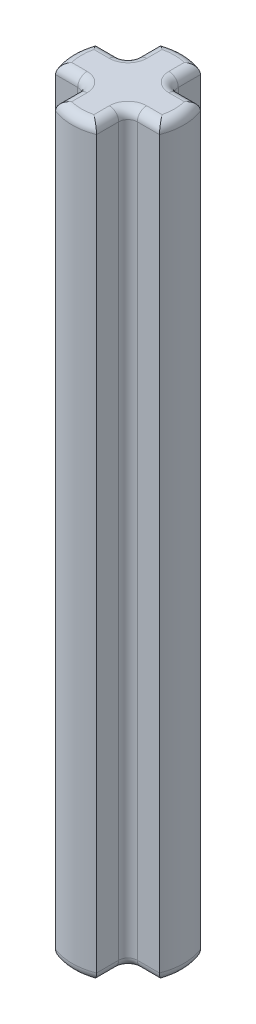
ISO-10303-21;
HEADER;
FILE_DESCRIPTION(('STEP AP214'),'2;1');
FILE_NAME('part.step','',(''),(''),'','','');
FILE_SCHEMA(('AUTOMOTIVE_DESIGN { 1 0 10303 214 1 1 1 1 }'));
ENDSEC;
DATA;
#1=APPLICATION_CONTEXT('core data for automotive mechanical design processes');
#2=APPLICATION_PROTOCOL_DEFINITION('international standard','automotive_design',2000,#1);
#3=PRODUCT_CONTEXT('',#1,'mechanical');
#4=PRODUCT('Part','Part','',(#3));
#5=PRODUCT_RELATED_PRODUCT_CATEGORY('part','',(#4));
#6=PRODUCT_DEFINITION_FORMATION('','',#4);
#7=PRODUCT_DEFINITION_CONTEXT('part definition',#1,'design');
#8=PRODUCT_DEFINITION('design','',#6,#7);
#9=PRODUCT_DEFINITION_SHAPE('','',#8);
#10=(LENGTH_UNIT() NAMED_UNIT(*) SI_UNIT(.MILLI.,.METRE.));
#11=(NAMED_UNIT(*) PLANE_ANGLE_UNIT() SI_UNIT($,.RADIAN.));
#12=(NAMED_UNIT(*) SI_UNIT($,.STERADIAN.) SOLID_ANGLE_UNIT());
#13=UNCERTAINTY_MEASURE_WITH_UNIT(LENGTH_MEASURE(1.E-05),#10,'distance_accuracy_value','');
#14=(GEOMETRIC_REPRESENTATION_CONTEXT(3) GLOBAL_UNCERTAINTY_ASSIGNED_CONTEXT((#13)) GLOBAL_UNIT_ASSIGNED_CONTEXT((#10,
#11,#12)) REPRESENTATION_CONTEXT('',''));
#15=CARTESIAN_POINT('',(0.,0.,0.));
#16=DIRECTION('',(0.,0.,1.));
#17=DIRECTION('',(1.,0.,0.));
#18=AXIS2_PLACEMENT_3D('',#15,#16,#17);
#19=CARTESIAN_POINT('',(0.,0.,0.));
#20=DIRECTION('',(0.,1.,0.));
#21=DIRECTION('',(0.,0.,1.));
#22=AXIS2_PLACEMENT_3D('',#19,#20,#21);
#23=PLANE('',#22);
#24=CARTESIAN_POINT('',(-1.28,0.,1.28));
#25=DIRECTION('',(0.,1.,0.));
#26=DIRECTION('',(0.,0.,1.));
#27=AXIS2_PLACEMENT_3D('',#24,#25,#26);
#28=CIRCLE('',#27,0.8);
#29=CARTESIAN_POINT('',(-1.28,0.,0.480000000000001));
#30=VERTEX_POINT('',#29);
#31=CARTESIAN_POINT('',(-0.48,0.,1.28));
#32=VERTEX_POINT('',#31);
#33=EDGE_CURVE('E262',#30,#32,#28,.F.);
#34=ORIENTED_EDGE('',*,*,#33,.F.);
#35=DIRECTION('',(1.,0.,0.));
#36=VECTOR('',#35,1.);
#37=CARTESIAN_POINT('',(0.,0.,0.480000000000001));
#38=LINE('',#37,#36);
#39=CARTESIAN_POINT('',(-1.94154577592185,0.,0.480000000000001));
#40=VERTEX_POINT('',#39);
#41=EDGE_CURVE('E324',#30,#40,#38,.F.);
#42=ORIENTED_EDGE('',*,*,#41,.T.);
#43=CARTESIAN_POINT('',(0.,0.,0.));
#44=DIRECTION('',(0.,1.,0.));
#45=DIRECTION('',(0.,0.,1.));
#46=AXIS2_PLACEMENT_3D('',#43,#44,#45);
#47=CIRCLE('',#46,2.);
#48=CARTESIAN_POINT('',(-1.94154577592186,0.,-0.48));
#49=VERTEX_POINT('',#48);
#50=EDGE_CURVE('E313',#40,#49,#47,.F.);
#51=ORIENTED_EDGE('',*,*,#50,.T.);
#52=DIRECTION('',(-1.,0.,0.));
#53=VECTOR('',#52,1.);
#54=CARTESIAN_POINT('',(0.,0.,-0.48));
#55=LINE('',#54,#53);
#56=CARTESIAN_POINT('',(-1.28,0.,-0.48));
#57=VERTEX_POINT('',#56);
#58=EDGE_CURVE('E301',#49,#57,#55,.F.);
#59=ORIENTED_EDGE('',*,*,#58,.T.);
#60=CARTESIAN_POINT('',(-1.28,0.,-1.28));
#61=DIRECTION('',(0.,1.,0.));
#62=DIRECTION('',(0.,0.,1.));
#63=AXIS2_PLACEMENT_3D('',#60,#61,#62);
#64=CIRCLE('',#63,0.8);
#65=CARTESIAN_POINT('',(-0.48,0.,-1.28));
#66=VERTEX_POINT('',#65);
#67=EDGE_CURVE('E298',#66,#57,#64,.F.);
#68=ORIENTED_EDGE('',*,*,#67,.F.);
#69=DIRECTION('',(0.,0.,1.));
#70=VECTOR('',#69,1.);
#71=CARTESIAN_POINT('',(-0.48,0.,0.));
#72=LINE('',#71,#70);
#73=CARTESIAN_POINT('',(-0.48,0.,-1.94154577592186));
#74=VERTEX_POINT('',#73);
#75=EDGE_CURVE('E289',#66,#74,#72,.F.);
#76=ORIENTED_EDGE('',*,*,#75,.T.);
#77=CARTESIAN_POINT('',(0.,0.,0.));
#78=DIRECTION('',(0.,1.,0.));
#79=DIRECTION('',(0.,0.,1.));
#80=AXIS2_PLACEMENT_3D('',#77,#78,#79);
#81=CIRCLE('',#80,2.);
#82=CARTESIAN_POINT('',(0.480000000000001,0.,-1.94154577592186));
#83=VERTEX_POINT('',#82);
#84=EDGE_CURVE('E294',#74,#83,#81,.F.);
#85=ORIENTED_EDGE('',*,*,#84,.T.);
#86=DIRECTION('',(0.,0.,-1.));
#87=VECTOR('',#86,1.);
#88=CARTESIAN_POINT('',(0.480000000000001,0.,0.));
#89=LINE('',#88,#87);
#90=CARTESIAN_POINT('',(0.480000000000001,0.,-1.28));
#91=VERTEX_POINT('',#90);
#92=EDGE_CURVE('E296',#83,#91,#89,.F.);
#93=ORIENTED_EDGE('',*,*,#92,.T.);
#94=CARTESIAN_POINT('',(1.28,0.,-1.28));
#95=DIRECTION('',(0.,1.,0.));
#96=DIRECTION('',(0.,0.,1.));
#97=AXIS2_PLACEMENT_3D('',#94,#95,#96);
#98=CIRCLE('',#97,0.8);
#99=CARTESIAN_POINT('',(1.28,0.,-0.48));
#100=VERTEX_POINT('',#99);
#101=EDGE_CURVE('E304',#100,#91,#98,.F.);
#102=ORIENTED_EDGE('',*,*,#101,.F.);
#103=DIRECTION('',(-1.,0.,0.));
#104=VECTOR('',#103,1.);
#105=CARTESIAN_POINT('',(0.,0.,-0.48));
#106=LINE('',#105,#104);
#107=CARTESIAN_POINT('',(1.94154577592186,0.,-0.48));
#108=VERTEX_POINT('',#107);
#109=EDGE_CURVE('E307',#100,#108,#106,.F.);
#110=ORIENTED_EDGE('',*,*,#109,.T.);
#111=CARTESIAN_POINT('',(0.,0.,0.));
#112=DIRECTION('',(0.,1.,0.));
#113=DIRECTION('',(0.,0.,1.));
#114=AXIS2_PLACEMENT_3D('',#111,#112,#113);
#115=CIRCLE('',#114,2.);
#116=CARTESIAN_POINT('',(1.94154577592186,0.,0.480000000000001));
#117=VERTEX_POINT('',#116);
#118=EDGE_CURVE('E309',#108,#117,#115,.F.);
#119=ORIENTED_EDGE('',*,*,#118,.T.);
#120=DIRECTION('',(1.,0.,0.));
#121=VECTOR('',#120,1.);
#122=CARTESIAN_POINT('',(0.,0.,0.480000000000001));
#123=LINE('',#122,#121);
#124=CARTESIAN_POINT('',(1.28,0.,0.480000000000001));
#125=VERTEX_POINT('',#124);
#126=EDGE_CURVE('E311',#117,#125,#123,.F.);
#127=ORIENTED_EDGE('',*,*,#126,.T.);
#128=CARTESIAN_POINT('',(1.28,0.,1.28));
#129=DIRECTION('',(0.,1.,0.));
#130=DIRECTION('',(0.,0.,1.));
#131=AXIS2_PLACEMENT_3D('',#128,#129,#130);
#132=CIRCLE('',#131,0.8);
#133=CARTESIAN_POINT('',(0.480000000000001,0.,1.28));
#134=VERTEX_POINT('',#133);
#135=EDGE_CURVE('E315',#134,#125,#132,.F.);
#136=ORIENTED_EDGE('',*,*,#135,.F.);
#137=DIRECTION('',(0.,0.,-1.));
#138=VECTOR('',#137,1.);
#139=CARTESIAN_POINT('',(0.480000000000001,0.,0.));
#140=LINE('',#139,#138);
#141=CARTESIAN_POINT('',(0.480000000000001,0.,1.94154577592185));
#142=VERTEX_POINT('',#141);
#143=EDGE_CURVE('E318',#134,#142,#140,.F.);
#144=ORIENTED_EDGE('',*,*,#143,.T.);
#145=CARTESIAN_POINT('',(0.,0.,0.));
#146=DIRECTION('',(0.,1.,0.));
#147=DIRECTION('',(0.,0.,1.));
#148=AXIS2_PLACEMENT_3D('',#145,#146,#147);
#149=CIRCLE('',#148,2.);
#150=CARTESIAN_POINT('',(-0.48,0.,1.94154577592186));
#151=VERTEX_POINT('',#150);
#152=EDGE_CURVE('E320',#142,#151,#149,.F.);
#153=ORIENTED_EDGE('',*,*,#152,.T.);
#154=DIRECTION('',(0.,0.,1.));
#155=VECTOR('',#154,1.);
#156=CARTESIAN_POINT('',(-0.48,0.,0.));
#157=LINE('',#156,#155);
#158=EDGE_CURVE('E322',#151,#32,#157,.F.);
#159=ORIENTED_EDGE('',*,*,#158,.T.);
#160=EDGE_LOOP('',(#34,#42,#51,#59,#68,#76,#85,#93,#102,#110,#119,#127,#136,#144,#153,#159));
#161=FACE_BOUND('',#160,.T.);
#162=ADVANCED_FACE('F36',(#161),#23,.F.);
#163=CARTESIAN_POINT('',(-0.88,32.,-2.23284571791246));
#164=DIRECTION('',(1.,0.,0.));
#165=DIRECTION('',(0.,0.,-1.));
#166=AXIS2_PLACEMENT_3D('',#163,#164,#165);
#167=PLANE('',#166);
#168=DIRECTION('',(0.,-1.,0.));
#169=VECTOR('',#168,1.);
#170=CARTESIAN_POINT('',(-0.88,32.,-2.23284571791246));
#171=LINE('',#170,#169);
#172=CARTESIAN_POINT('',(-0.88,31.6,-2.23284571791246));
#173=VERTEX_POINT('',#172);
#174=CARTESIAN_POINT('',(-0.88,0.399999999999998,-2.23284571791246));
#175=VERTEX_POINT('',#174);
#176=EDGE_CURVE('E684',#173,#175,#171,.T.);
#177=ORIENTED_EDGE('',*,*,#176,.T.);
#178=DIRECTION('',(0.,0.,1.));
#179=VECTOR('',#178,1.);
#180=CARTESIAN_POINT('',(-0.88,0.399999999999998,-2.23284571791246));
#181=LINE('',#180,#179);
#182=CARTESIAN_POINT('',(-0.88,0.399999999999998,-1.28));
#183=VERTEX_POINT('',#182);
#184=EDGE_CURVE('E384',#175,#183,#181,.T.);
#185=ORIENTED_EDGE('',*,*,#184,.T.);
#186=DIRECTION('',(0.,-1.,0.));
#187=VECTOR('',#186,1.);
#188=CARTESIAN_POINT('',(-0.88,32.,-1.28));
#189=LINE('',#188,#187);
#190=CARTESIAN_POINT('',(-0.88,31.6,-1.28));
#191=VERTEX_POINT('',#190);
#192=EDGE_CURVE('E380',#183,#191,#189,.F.);
#193=ORIENTED_EDGE('',*,*,#192,.T.);
#194=DIRECTION('',(0.,0.,1.));
#195=VECTOR('',#194,1.);
#196=CARTESIAN_POINT('',(-0.88,31.6,-2.23284571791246));
#197=LINE('',#196,#195);
#198=EDGE_CURVE('E382',#191,#173,#197,.F.);
#199=ORIENTED_EDGE('',*,*,#198,.T.);
#200=EDGE_LOOP('',(#177,#185,#193,#199));
#201=FACE_BOUND('',#200,.T.);
#202=ADVANCED_FACE('F777',(#201),#167,.F.);
#203=CARTESIAN_POINT('',(-2.23284571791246,32.,-0.88));
#204=DIRECTION('',(0.,0.,1.));
#205=DIRECTION('',(1.,0.,0.));
#206=AXIS2_PLACEMENT_3D('',#203,#204,#205);
#207=PLANE('',#206);
#208=DIRECTION('',(0.,-1.,0.));
#209=VECTOR('',#208,1.);
#210=CARTESIAN_POINT('',(-1.28,0.,-0.88));
#211=LINE('',#210,#209);
#212=CARTESIAN_POINT('',(-1.28,31.6,-0.88));
#213=VERTEX_POINT('',#212);
#214=CARTESIAN_POINT('',(-1.28,0.399999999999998,-0.88));
#215=VERTEX_POINT('',#214);
#216=EDGE_CURVE('E272',#213,#215,#211,.T.);
#217=ORIENTED_EDGE('',*,*,#216,.T.);
#218=DIRECTION('',(-1.,0.,0.));
#219=VECTOR('',#218,1.);
#220=CARTESIAN_POINT('',(-2.23284571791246,0.399999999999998,-0.88));
#221=LINE('',#220,#219);
#222=CARTESIAN_POINT('',(-2.23284571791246,0.399999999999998,-0.88));
#223=VERTEX_POINT('',#222);
#224=EDGE_CURVE('E271',#215,#223,#221,.T.);
#225=ORIENTED_EDGE('',*,*,#224,.T.);
#226=DIRECTION('',(0.,-1.,0.));
#227=VECTOR('',#226,1.);
#228=CARTESIAN_POINT('',(-2.23284571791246,32.,-0.88));
#229=LINE('',#228,#227);
#230=CARTESIAN_POINT('',(-2.23284571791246,31.6,-0.88));
#231=VERTEX_POINT('',#230);
#232=EDGE_CURVE('E254',#231,#223,#229,.T.);
#233=ORIENTED_EDGE('',*,*,#232,.F.);
#234=DIRECTION('',(-1.,0.,0.));
#235=VECTOR('',#234,1.);
#236=CARTESIAN_POINT('',(-0.88,31.6,-0.88));
#237=LINE('',#236,#235);
#238=EDGE_CURVE('E268',#231,#213,#237,.F.);
#239=ORIENTED_EDGE('',*,*,#238,.T.);
#240=EDGE_LOOP('',(#217,#225,#233,#239));
#241=FACE_BOUND('',#240,.T.);
#242=ADVANCED_FACE('F266',(#241),#207,.F.);
#243=CARTESIAN_POINT('',(0.,32.,0.));
#244=DIRECTION('',(0.,-1.,0.));
#245=DIRECTION('',(0.,0.,-1.));
#246=AXIS2_PLACEMENT_3D('',#243,#244,#245);
#247=CYLINDRICAL_SURFACE('',#246,2.4);
#248=ORIENTED_EDGE('',*,*,#232,.T.);
#249=CARTESIAN_POINT('',(0.,0.399999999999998,0.));
#250=DIRECTION('',(0.,1.,0.));
#251=DIRECTION('',(0.,0.,1.));
#252=AXIS2_PLACEMENT_3D('',#249,#250,#251);
#253=CIRCLE('',#252,2.4);
#254=CARTESIAN_POINT('',(-2.23284571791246,0.399999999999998,0.880000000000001));
#255=VERTEX_POINT('',#254);
#256=EDGE_CURVE('E261',#223,#255,#253,.T.);
#257=ORIENTED_EDGE('',*,*,#256,.T.);
#258=DIRECTION('',(0.,-1.,0.));
#259=VECTOR('',#258,1.);
#260=CARTESIAN_POINT('',(-2.23284571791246,32.,0.880000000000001));
#261=LINE('',#260,#259);
#262=CARTESIAN_POINT('',(-2.23284571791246,31.6,0.880000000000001));
#263=VERTEX_POINT('',#262);
#264=EDGE_CURVE('E256',#263,#255,#261,.T.);
#265=ORIENTED_EDGE('',*,*,#264,.F.);
#266=CARTESIAN_POINT('',(0.,31.6,0.));
#267=DIRECTION('',(0.,1.,0.));
#268=DIRECTION('',(0.,0.,1.));
#269=AXIS2_PLACEMENT_3D('',#266,#267,#268);
#270=CIRCLE('',#269,2.4);
#271=EDGE_CURVE('E251',#263,#231,#270,.F.);
#272=ORIENTED_EDGE('',*,*,#271,.T.);
#273=EDGE_LOOP('',(#248,#257,#265,#272));
#274=FACE_BOUND('',#273,.T.);
#275=ADVANCED_FACE('F253',(#274),#247,.T.);
#276=CARTESIAN_POINT('',(-0.88,32.,0.880000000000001));
#277=DIRECTION('',(0.,0.,-1.));
#278=DIRECTION('',(-1.,0.,0.));
#279=AXIS2_PLACEMENT_3D('',#276,#277,#278);
#280=PLANE('',#279);
#281=ORIENTED_EDGE('',*,*,#264,.T.);
#282=DIRECTION('',(1.,0.,0.));
#283=VECTOR('',#282,1.);
#284=CARTESIAN_POINT('',(-0.88,0.399999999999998,0.880000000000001));
#285=LINE('',#284,#283);
#286=CARTESIAN_POINT('',(-1.28,0.399999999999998,0.880000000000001));
#287=VERTEX_POINT('',#286);
#288=EDGE_CURVE('E333',#255,#287,#285,.T.);
#289=ORIENTED_EDGE('',*,*,#288,.T.);
#290=DIRECTION('',(0.,-1.,0.));
#291=VECTOR('',#290,1.);
#292=CARTESIAN_POINT('',(-1.28,32.,0.880000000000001));
#293=LINE('',#292,#291);
#294=CARTESIAN_POINT('',(-1.28,31.6,0.880000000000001));
#295=VERTEX_POINT('',#294);
#296=EDGE_CURVE('E329',#287,#295,#293,.F.);
#297=ORIENTED_EDGE('',*,*,#296,.T.);
#298=DIRECTION('',(1.,0.,0.));
#299=VECTOR('',#298,1.);
#300=CARTESIAN_POINT('',(-2.23284571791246,31.6,0.880000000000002));
#301=LINE('',#300,#299);
#302=EDGE_CURVE('E331',#295,#263,#301,.F.);
#303=ORIENTED_EDGE('',*,*,#302,.T.);
#304=EDGE_LOOP('',(#281,#289,#297,#303));
#305=FACE_BOUND('',#304,.T.);
#306=ADVANCED_FACE('F710',(#305),#280,.F.);
#307=CARTESIAN_POINT('',(-0.88,32.,0.880000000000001));
#308=DIRECTION('',(1.,0.,0.));
#309=DIRECTION('',(0.,0.,-1.));
#310=AXIS2_PLACEMENT_3D('',#307,#308,#309);
#311=PLANE('',#310);
#312=DIRECTION('',(0.,-1.,0.));
#313=VECTOR('',#312,1.);
#314=CARTESIAN_POINT('',(-0.88,0.,1.28));
#315=LINE('',#314,#313);
#316=CARTESIAN_POINT('',(-0.88,31.6,1.28));
#317=VERTEX_POINT('',#316);
#318=CARTESIAN_POINT('',(-0.88,0.399999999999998,1.28));
#319=VERTEX_POINT('',#318);
#320=EDGE_CURVE('E335',#317,#319,#315,.T.);
#321=ORIENTED_EDGE('',*,*,#320,.T.);
#322=DIRECTION('',(0.,0.,1.));
#323=VECTOR('',#322,1.);
#324=CARTESIAN_POINT('',(-0.88,0.399999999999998,0.880000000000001));
#325=LINE('',#324,#323);
#326=CARTESIAN_POINT('',(-0.88,0.399999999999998,2.23284571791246));
#327=VERTEX_POINT('',#326);
#328=EDGE_CURVE('E339',#319,#327,#325,.T.);
#329=ORIENTED_EDGE('',*,*,#328,.T.);
#330=DIRECTION('',(0.,-1.,0.));
#331=VECTOR('',#330,1.);
#332=CARTESIAN_POINT('',(-0.88,32.,2.23284571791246));
#333=LINE('',#332,#331);
#334=CARTESIAN_POINT('',(-0.88,31.6,2.23284571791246));
#335=VERTEX_POINT('',#334);
#336=EDGE_CURVE('E705',#335,#327,#333,.T.);
#337=ORIENTED_EDGE('',*,*,#336,.F.);
#338=DIRECTION('',(0.,0.,1.));
#339=VECTOR('',#338,1.);
#340=CARTESIAN_POINT('',(-0.88,31.6,0.880000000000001));
#341=LINE('',#340,#339);
#342=EDGE_CURVE('E337',#335,#317,#341,.F.);
#343=ORIENTED_EDGE('',*,*,#342,.T.);
#344=EDGE_LOOP('',(#321,#329,#337,#343));
#345=FACE_BOUND('',#344,.T.);
#346=ADVANCED_FACE('F808',(#345),#311,.F.);
#347=CARTESIAN_POINT('',(0.,32.,0.));
#348=DIRECTION('',(0.,-1.,0.));
#349=DIRECTION('',(0.,0.,-1.));
#350=AXIS2_PLACEMENT_3D('',#347,#348,#349);
#351=CYLINDRICAL_SURFACE('',#350,2.4);
#352=ORIENTED_EDGE('',*,*,#336,.T.);
#353=CARTESIAN_POINT('',(0.,0.399999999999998,0.));
#354=DIRECTION('',(0.,1.,0.));
#355=DIRECTION('',(0.,0.,1.));
#356=AXIS2_PLACEMENT_3D('',#353,#354,#355);
#357=CIRCLE('',#356,2.4);
#358=CARTESIAN_POINT('',(0.88,0.399999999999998,2.23284571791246));
#359=VERTEX_POINT('',#358);
#360=EDGE_CURVE('E344',#327,#359,#357,.T.);
#361=ORIENTED_EDGE('',*,*,#360,.T.);
#362=DIRECTION('',(0.,-1.,0.));
#363=VECTOR('',#362,1.);
#364=CARTESIAN_POINT('',(0.88,32.,2.23284571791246));
#365=LINE('',#364,#363);
#366=CARTESIAN_POINT('',(0.88,31.6,2.23284571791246));
#367=VERTEX_POINT('',#366);
#368=EDGE_CURVE('E702',#367,#359,#365,.T.);
#369=ORIENTED_EDGE('',*,*,#368,.F.);
#370=CARTESIAN_POINT('',(0.,31.6,0.));
#371=DIRECTION('',(0.,1.,0.));
#372=DIRECTION('',(0.,0.,1.));
#373=AXIS2_PLACEMENT_3D('',#370,#371,#372);
#374=CIRCLE('',#373,2.4);
#375=EDGE_CURVE('E342',#367,#335,#374,.F.);
#376=ORIENTED_EDGE('',*,*,#375,.T.);
#377=EDGE_LOOP('',(#352,#361,#369,#376));
#378=FACE_BOUND('',#377,.T.);
#379=ADVANCED_FACE('F804',(#378),#351,.T.);
#380=CARTESIAN_POINT('',(0.880000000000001,32.,2.23284571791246));
#381=DIRECTION('',(-1.,0.,0.));
#382=DIRECTION('',(0.,0.,1.));
#383=AXIS2_PLACEMENT_3D('',#380,#381,#382);
#384=PLANE('',#383);
#385=ORIENTED_EDGE('',*,*,#368,.T.);
#386=DIRECTION('',(0.,0.,-1.));
#387=VECTOR('',#386,1.);
#388=CARTESIAN_POINT('',(0.880000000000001,0.399999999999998,2.23284571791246));
#389=LINE('',#388,#387);
#390=CARTESIAN_POINT('',(0.880000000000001,0.399999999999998,1.28));
#391=VERTEX_POINT('',#390);
#392=EDGE_CURVE('E350',#359,#391,#389,.T.);
#393=ORIENTED_EDGE('',*,*,#392,.T.);
#394=DIRECTION('',(0.,-1.,0.));
#395=VECTOR('',#394,1.);
#396=CARTESIAN_POINT('',(0.880000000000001,32.,1.28));
#397=LINE('',#396,#395);
#398=CARTESIAN_POINT('',(0.880000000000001,31.6,1.28));
#399=VERTEX_POINT('',#398);
#400=EDGE_CURVE('E346',#391,#399,#397,.F.);
#401=ORIENTED_EDGE('',*,*,#400,.T.);
#402=DIRECTION('',(0.,0.,-1.));
#403=VECTOR('',#402,1.);
#404=CARTESIAN_POINT('',(0.880000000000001,31.6,2.23284571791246));
#405=LINE('',#404,#403);
#406=EDGE_CURVE('E348',#399,#367,#405,.F.);
#407=ORIENTED_EDGE('',*,*,#406,.T.);
#408=EDGE_LOOP('',(#385,#393,#401,#407));
#409=FACE_BOUND('',#408,.T.);
#410=ADVANCED_FACE('F800',(#409),#384,.F.);
#411=CARTESIAN_POINT('',(2.23284571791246,32.,0.880000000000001));
#412=DIRECTION('',(0.,0.,-1.));
#413=DIRECTION('',(-1.,0.,0.));
#414=AXIS2_PLACEMENT_3D('',#411,#412,#413);
#415=PLANE('',#414);
#416=DIRECTION('',(0.,-1.,0.));
#417=VECTOR('',#416,1.);
#418=CARTESIAN_POINT('',(1.28,0.,0.880000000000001));
#419=LINE('',#418,#417);
#420=CARTESIAN_POINT('',(1.28,31.6,0.880000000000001));
#421=VERTEX_POINT('',#420);
#422=CARTESIAN_POINT('',(1.28,0.399999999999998,0.880000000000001));
#423=VERTEX_POINT('',#422);
#424=EDGE_CURVE('E352',#421,#423,#419,.T.);
#425=ORIENTED_EDGE('',*,*,#424,.T.);
#426=DIRECTION('',(1.,0.,0.));
#427=VECTOR('',#426,1.);
#428=CARTESIAN_POINT('',(2.23284571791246,0.399999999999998,0.880000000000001));
#429=LINE('',#428,#427);
#430=CARTESIAN_POINT('',(2.23284571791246,0.399999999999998,0.880000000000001));
#431=VERTEX_POINT('',#430);
#432=EDGE_CURVE('E356',#423,#431,#429,.T.);
#433=ORIENTED_EDGE('',*,*,#432,.T.);
#434=DIRECTION('',(0.,-1.,0.));
#435=VECTOR('',#434,1.);
#436=CARTESIAN_POINT('',(2.23284571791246,32.,0.880000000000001));
#437=LINE('',#436,#435);
#438=CARTESIAN_POINT('',(2.23284571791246,31.6,0.880000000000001));
#439=VERTEX_POINT('',#438);
#440=EDGE_CURVE('E699',#439,#431,#437,.T.);
#441=ORIENTED_EDGE('',*,*,#440,.F.);
#442=DIRECTION('',(1.,0.,0.));
#443=VECTOR('',#442,1.);
#444=CARTESIAN_POINT('',(0.880000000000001,31.6,0.880000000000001));
#445=LINE('',#444,#443);
#446=EDGE_CURVE('E354',#439,#421,#445,.F.);
#447=ORIENTED_EDGE('',*,*,#446,.T.);
#448=EDGE_LOOP('',(#425,#433,#441,#447));
#449=FACE_BOUND('',#448,.T.);
#450=ADVANCED_FACE('F796',(#449),#415,.F.);
#451=CARTESIAN_POINT('',(0.,32.,0.));
#452=DIRECTION('',(0.,-1.,0.));
#453=DIRECTION('',(0.,0.,-1.));
#454=AXIS2_PLACEMENT_3D('',#451,#452,#453);
#455=CYLINDRICAL_SURFACE('',#454,2.4);
#456=ORIENTED_EDGE('',*,*,#440,.T.);
#457=CARTESIAN_POINT('',(0.,0.399999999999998,0.));
#458=DIRECTION('',(0.,1.,0.));
#459=DIRECTION('',(0.,0.,1.));
#460=AXIS2_PLACEMENT_3D('',#457,#458,#459);
#461=CIRCLE('',#460,2.4);
#462=CARTESIAN_POINT('',(2.23284571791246,0.399999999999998,-0.88));
#463=VERTEX_POINT('',#462);
#464=EDGE_CURVE('E361',#431,#463,#461,.T.);
#465=ORIENTED_EDGE('',*,*,#464,.T.);
#466=DIRECTION('',(0.,-1.,0.));
#467=VECTOR('',#466,1.);
#468=CARTESIAN_POINT('',(2.23284571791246,32.,-0.88));
#469=LINE('',#468,#467);
#470=CARTESIAN_POINT('',(2.23284571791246,31.6,-0.88));
#471=VERTEX_POINT('',#470);
#472=EDGE_CURVE('E694',#471,#463,#469,.T.);
#473=ORIENTED_EDGE('',*,*,#472,.F.);
#474=CARTESIAN_POINT('',(0.,31.6,0.));
#475=DIRECTION('',(0.,1.,0.));
#476=DIRECTION('',(0.,0.,1.));
#477=AXIS2_PLACEMENT_3D('',#474,#475,#476);
#478=CIRCLE('',#477,2.4);
#479=EDGE_CURVE('E359',#471,#439,#478,.F.);
#480=ORIENTED_EDGE('',*,*,#479,.T.);
#481=EDGE_LOOP('',(#456,#465,#473,#480));
#482=FACE_BOUND('',#481,.T.);
#483=ADVANCED_FACE('F792',(#482),#455,.T.);
#484=CARTESIAN_POINT('',(0.880000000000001,32.,-0.88));
#485=DIRECTION('',(0.,0.,1.));
#486=DIRECTION('',(1.,0.,0.));
#487=AXIS2_PLACEMENT_3D('',#484,#485,#486);
#488=PLANE('',#487);
#489=ORIENTED_EDGE('',*,*,#472,.T.);
#490=DIRECTION('',(-1.,0.,0.));
#491=VECTOR('',#490,1.);
#492=CARTESIAN_POINT('',(0.880000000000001,0.399999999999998,-0.88));
#493=LINE('',#492,#491);
#494=CARTESIAN_POINT('',(1.28,0.399999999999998,-0.88));
#495=VERTEX_POINT('',#494);
#496=EDGE_CURVE('E367',#463,#495,#493,.T.);
#497=ORIENTED_EDGE('',*,*,#496,.T.);
#498=DIRECTION('',(0.,-1.,0.));
#499=VECTOR('',#498,1.);
#500=CARTESIAN_POINT('',(1.28,32.,-0.88));
#501=LINE('',#500,#499);
#502=CARTESIAN_POINT('',(1.28,31.6,-0.88));
#503=VERTEX_POINT('',#502);
#504=EDGE_CURVE('E363',#495,#503,#501,.F.);
#505=ORIENTED_EDGE('',*,*,#504,.T.);
#506=DIRECTION('',(-1.,0.,0.));
#507=VECTOR('',#506,1.);
#508=CARTESIAN_POINT('',(2.23284571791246,31.6,-0.88));
#509=LINE('',#508,#507);
#510=EDGE_CURVE('E365',#503,#471,#509,.F.);
#511=ORIENTED_EDGE('',*,*,#510,.T.);
#512=EDGE_LOOP('',(#489,#497,#505,#511));
#513=FACE_BOUND('',#512,.T.);
#514=ADVANCED_FACE('F789',(#513),#488,.F.);
#515=CARTESIAN_POINT('',(0.880000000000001,32.,-0.88));
#516=DIRECTION('',(-1.,0.,0.));
#517=DIRECTION('',(0.,0.,1.));
#518=AXIS2_PLACEMENT_3D('',#515,#516,#517);
#519=PLANE('',#518);
#520=DIRECTION('',(0.,-1.,0.));
#521=VECTOR('',#520,1.);
#522=CARTESIAN_POINT('',(0.880000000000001,0.,-1.28));
#523=LINE('',#522,#521);
#524=CARTESIAN_POINT('',(0.880000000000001,31.6,-1.28));
#525=VERTEX_POINT('',#524);
#526=CARTESIAN_POINT('',(0.880000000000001,0.399999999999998,-1.28));
#527=VERTEX_POINT('',#526);
#528=EDGE_CURVE('E369',#525,#527,#523,.T.);
#529=ORIENTED_EDGE('',*,*,#528,.T.);
#530=DIRECTION('',(0.,0.,-1.));
#531=VECTOR('',#530,1.);
#532=CARTESIAN_POINT('',(0.880000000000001,0.399999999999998,-0.88));
#533=LINE('',#532,#531);
#534=CARTESIAN_POINT('',(0.880000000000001,0.399999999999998,-2.23284571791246));
#535=VERTEX_POINT('',#534);
#536=EDGE_CURVE('E373',#527,#535,#533,.T.);
#537=ORIENTED_EDGE('',*,*,#536,.T.);
#538=DIRECTION('',(0.,-1.,0.));
#539=VECTOR('',#538,1.);
#540=CARTESIAN_POINT('',(0.880000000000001,32.,-2.23284571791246));
#541=LINE('',#540,#539);
#542=CARTESIAN_POINT('',(0.880000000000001,31.6,-2.23284571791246));
#543=VERTEX_POINT('',#542);
#544=EDGE_CURVE('E688',#543,#535,#541,.T.);
#545=ORIENTED_EDGE('',*,*,#544,.F.);
#546=DIRECTION('',(0.,0.,-1.));
#547=VECTOR('',#546,1.);
#548=CARTESIAN_POINT('',(0.880000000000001,31.6,-0.88));
#549=LINE('',#548,#547);
#550=EDGE_CURVE('E371',#543,#525,#549,.F.);
#551=ORIENTED_EDGE('',*,*,#550,.T.);
#552=EDGE_LOOP('',(#529,#537,#545,#551));
#553=FACE_BOUND('',#552,.T.);
#554=ADVANCED_FACE('F730',(#553),#519,.F.);
#555=CARTESIAN_POINT('',(0.,32.,0.));
#556=DIRECTION('',(0.,-1.,0.));
#557=DIRECTION('',(0.,0.,-1.));
#558=AXIS2_PLACEMENT_3D('',#555,#556,#557);
#559=CYLINDRICAL_SURFACE('',#558,2.4);
#560=ORIENTED_EDGE('',*,*,#544,.T.);
#561=CARTESIAN_POINT('',(0.,0.399999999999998,0.));
#562=DIRECTION('',(0.,1.,0.));
#563=DIRECTION('',(0.,0.,1.));
#564=AXIS2_PLACEMENT_3D('',#561,#562,#563);
#565=CIRCLE('',#564,2.4);
#566=EDGE_CURVE('E378',#535,#175,#565,.T.);
#567=ORIENTED_EDGE('',*,*,#566,.T.);
#568=ORIENTED_EDGE('',*,*,#176,.F.);
#569=CARTESIAN_POINT('',(0.,31.6,0.));
#570=DIRECTION('',(0.,1.,0.));
#571=DIRECTION('',(0.,0.,1.));
#572=AXIS2_PLACEMENT_3D('',#569,#570,#571);
#573=CIRCLE('',#572,2.4);
#574=EDGE_CURVE('E376',#173,#543,#573,.F.);
#575=ORIENTED_EDGE('',*,*,#574,.T.);
#576=EDGE_LOOP('',(#560,#567,#568,#575));
#577=FACE_BOUND('',#576,.T.);
#578=ADVANCED_FACE('F734',(#577),#559,.T.);
#579=CARTESIAN_POINT('',(0.,32.,0.));
#580=DIRECTION('',(0.,1.,0.));
#581=DIRECTION('',(0.,0.,1.));
#582=AXIS2_PLACEMENT_3D('',#579,#580,#581);
#583=PLANE('',#582);
#584=CARTESIAN_POINT('',(0.,32.,0.));
#585=DIRECTION('',(0.,1.,0.));
#586=DIRECTION('',(0.,0.,1.));
#587=AXIS2_PLACEMENT_3D('',#584,#585,#586);
#588=CIRCLE('',#587,2.);
#589=CARTESIAN_POINT('',(1.94154577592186,32.,0.480000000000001));
#590=VERTEX_POINT('',#589);
#591=CARTESIAN_POINT('',(1.94154577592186,32.,-0.48));
#592=VERTEX_POINT('',#591);
#593=EDGE_CURVE('E62',#590,#592,#588,.T.);
#594=ORIENTED_EDGE('',*,*,#593,.T.);
#595=DIRECTION('',(-1.,0.,0.));
#596=VECTOR('',#595,1.);
#597=CARTESIAN_POINT('',(0.880000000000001,32.,-0.48));
#598=LINE('',#597,#596);
#599=CARTESIAN_POINT('',(1.28,32.,-0.48));
#600=VERTEX_POINT('',#599);
#601=EDGE_CURVE('E11',#592,#600,#598,.T.);
#602=ORIENTED_EDGE('',*,*,#601,.T.);
#603=CARTESIAN_POINT('',(1.28,32.,-1.28));
#604=DIRECTION('',(0.,1.,0.));
#605=DIRECTION('',(0.,0.,1.));
#606=AXIS2_PLACEMENT_3D('',#603,#604,#605);
#607=CIRCLE('',#606,0.8);
#608=CARTESIAN_POINT('',(0.480000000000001,32.,-1.28));
#609=VERTEX_POINT('',#608);
#610=EDGE_CURVE('E51',#609,#600,#607,.T.);
#611=ORIENTED_EDGE('',*,*,#610,.F.);
#612=DIRECTION('',(0.,0.,-1.));
#613=VECTOR('',#612,1.);
#614=CARTESIAN_POINT('',(0.480000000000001,32.,-2.23284571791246));
#615=LINE('',#614,#613);
#616=CARTESIAN_POINT('',(0.480000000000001,32.,-1.94154577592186));
#617=VERTEX_POINT('',#616);
#618=EDGE_CURVE('E408',#609,#617,#615,.T.);
#619=ORIENTED_EDGE('',*,*,#618,.T.);
#620=CARTESIAN_POINT('',(0.,32.,0.));
#621=DIRECTION('',(0.,1.,0.));
#622=DIRECTION('',(0.,0.,1.));
#623=AXIS2_PLACEMENT_3D('',#620,#621,#622);
#624=CIRCLE('',#623,2.);
#625=CARTESIAN_POINT('',(-0.48,32.,-1.94154577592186));
#626=VERTEX_POINT('',#625);
#627=EDGE_CURVE('E396',#617,#626,#624,.T.);
#628=ORIENTED_EDGE('',*,*,#627,.T.);
#629=DIRECTION('',(0.,0.,1.));
#630=VECTOR('',#629,1.);
#631=CARTESIAN_POINT('',(-0.48,32.,-0.88));
#632=LINE('',#631,#630);
#633=CARTESIAN_POINT('',(-0.48,32.,-1.28));
#634=VERTEX_POINT('',#633);
#635=EDGE_CURVE('E389',#626,#634,#632,.T.);
#636=ORIENTED_EDGE('',*,*,#635,.T.);
#637=CARTESIAN_POINT('',(-1.28,32.,-1.28));
#638=DIRECTION('',(0.,1.,0.));
#639=DIRECTION('',(0.,0.,1.));
#640=AXIS2_PLACEMENT_3D('',#637,#638,#639);
#641=CIRCLE('',#640,0.8);
#642=CARTESIAN_POINT('',(-1.28,32.,-0.48));
#643=VERTEX_POINT('',#642);
#644=EDGE_CURVE('E386',#643,#634,#641,.T.);
#645=ORIENTED_EDGE('',*,*,#644,.F.);
#646=DIRECTION('',(-1.,0.,0.));
#647=VECTOR('',#646,1.);
#648=CARTESIAN_POINT('',(-2.23284571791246,32.,-0.48));
#649=LINE('',#648,#647);
#650=CARTESIAN_POINT('',(-1.94154577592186,32.,-0.48));
#651=VERTEX_POINT('',#650);
#652=EDGE_CURVE('E391',#643,#651,#649,.T.);
#653=ORIENTED_EDGE('',*,*,#652,.T.);
#654=CARTESIAN_POINT('',(0.,32.,0.));
#655=DIRECTION('',(0.,1.,0.));
#656=DIRECTION('',(0.,0.,1.));
#657=AXIS2_PLACEMENT_3D('',#654,#655,#656);
#658=CIRCLE('',#657,2.);
#659=CARTESIAN_POINT('',(-1.94154577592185,32.,0.480000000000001));
#660=VERTEX_POINT('',#659);
#661=EDGE_CURVE('E278',#651,#660,#658,.T.);
#662=ORIENTED_EDGE('',*,*,#661,.T.);
#663=DIRECTION('',(1.,0.,0.));
#664=VECTOR('',#663,1.);
#665=CARTESIAN_POINT('',(-0.88,32.,0.480000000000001));
#666=LINE('',#665,#664);
#667=CARTESIAN_POINT('',(-1.28,32.,0.480000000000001));
#668=VERTEX_POINT('',#667);
#669=EDGE_CURVE('E394',#660,#668,#666,.T.);
#670=ORIENTED_EDGE('',*,*,#669,.T.);
#671=CARTESIAN_POINT('',(-1.28,32.,1.28));
#672=DIRECTION('',(0.,1.,0.));
#673=DIRECTION('',(0.,0.,1.));
#674=AXIS2_PLACEMENT_3D('',#671,#672,#673);
#675=CIRCLE('',#674,0.8);
#676=CARTESIAN_POINT('',(-0.48,32.,1.28));
#677=VERTEX_POINT('',#676);
#678=EDGE_CURVE('E399',#677,#668,#675,.T.);
#679=ORIENTED_EDGE('',*,*,#678,.F.);
#680=DIRECTION('',(0.,0.,1.));
#681=VECTOR('',#680,1.);
#682=CARTESIAN_POINT('',(-0.48,32.,2.23284571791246));
#683=LINE('',#682,#681);
#684=CARTESIAN_POINT('',(-0.48,32.,1.94154577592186));
#685=VERTEX_POINT('',#684);
#686=EDGE_CURVE('E402',#677,#685,#683,.T.);
#687=ORIENTED_EDGE('',*,*,#686,.T.);
#688=CARTESIAN_POINT('',(0.,32.,0.));
#689=DIRECTION('',(0.,1.,0.));
#690=DIRECTION('',(0.,0.,1.));
#691=AXIS2_PLACEMENT_3D('',#688,#689,#690);
#692=CIRCLE('',#691,2.);
#693=CARTESIAN_POINT('',(0.48,32.,1.94154577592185));
#694=VERTEX_POINT('',#693);
#695=EDGE_CURVE('E404',#685,#694,#692,.T.);
#696=ORIENTED_EDGE('',*,*,#695,.T.);
#697=DIRECTION('',(0.,0.,-1.));
#698=VECTOR('',#697,1.);
#699=CARTESIAN_POINT('',(0.480000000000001,32.,0.880000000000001));
#700=LINE('',#699,#698);
#701=CARTESIAN_POINT('',(0.480000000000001,32.,1.28));
#702=VERTEX_POINT('',#701);
#703=EDGE_CURVE('E406',#694,#702,#700,.T.);
#704=ORIENTED_EDGE('',*,*,#703,.T.);
#705=CARTESIAN_POINT('',(1.28,32.,1.28));
#706=DIRECTION('',(0.,1.,0.));
#707=DIRECTION('',(0.,0.,1.));
#708=AXIS2_PLACEMENT_3D('',#705,#706,#707);
#709=CIRCLE('',#708,0.8);
#710=CARTESIAN_POINT('',(1.28,32.,0.480000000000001));
#711=VERTEX_POINT('',#710);
#712=EDGE_CURVE('E410',#711,#702,#709,.T.);
#713=ORIENTED_EDGE('',*,*,#712,.F.);
#714=DIRECTION('',(1.,0.,0.));
#715=VECTOR('',#714,1.);
#716=CARTESIAN_POINT('',(2.23284571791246,32.,0.480000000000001));
#717=LINE('',#716,#715);
#718=EDGE_CURVE('E413',#711,#590,#717,.T.);
#719=ORIENTED_EDGE('',*,*,#718,.T.);
#720=EDGE_LOOP('',(#594,#602,#611,#619,#628,#636,#645,#653,#662,#670,#679,#687,#696,#704,#713,#719));
#721=FACE_BOUND('',#720,.T.);
#722=ADVANCED_FACE('F784',(#721),#583,.T.);
#723=CARTESIAN_POINT('',(0.,31.6,0.480000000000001));
#724=DIRECTION('',(-1.,0.,0.));
#725=DIRECTION('',(0.,0.,1.));
#726=AXIS2_PLACEMENT_3D('',#723,#724,#725);
#727=CYLINDRICAL_SURFACE('',#726,0.4);
#728=CARTESIAN_POINT('',(1.28,31.6,0.480000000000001));
#729=DIRECTION('',(-1.,0.,0.));
#730=DIRECTION('',(0.,0.,1.));
#731=AXIS2_PLACEMENT_3D('',#728,#729,#730);
#732=CIRCLE('',#731,0.4);
#733=EDGE_CURVE('E677',#421,#711,#732,.T.);
#734=ORIENTED_EDGE('',*,*,#733,.F.);
#735=ORIENTED_EDGE('',*,*,#446,.F.);
#736=CARTESIAN_POINT('',(2.23284571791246,31.6,0.880000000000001));
#737=CARTESIAN_POINT('',(2.23286229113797,31.6196677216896,0.880027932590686));
#738=CARTESIAN_POINT('',(2.23185960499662,31.6393093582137,0.878551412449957));
#739=CARTESIAN_POINT('',(2.22795221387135,31.6778900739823,0.872817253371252));
#740=CARTESIAN_POINT('',(2.22505712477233,31.6968321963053,0.86857367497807));
#741=CARTESIAN_POINT('',(2.21750324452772,31.7335523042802,0.85753531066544));
#742=CARTESIAN_POINT('',(2.21284643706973,31.7513315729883,0.850743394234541));
#743=CARTESIAN_POINT('',(2.20197052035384,31.7853742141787,0.834948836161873));
#744=CARTESIAN_POINT('',(2.19574983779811,31.8016360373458,0.825943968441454));
#745=CARTESIAN_POINT('',(2.18156387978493,31.8332696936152,0.805515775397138));
#746=CARTESIAN_POINT('',(2.1735174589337,31.8485327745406,0.793981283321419));
#747=CARTESIAN_POINT('',(2.15618491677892,31.8768786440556,0.769295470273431));
#748=CARTESIAN_POINT('',(2.14689846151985,31.8899608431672,0.756143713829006));
#749=CARTESIAN_POINT('',(2.12572929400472,31.9158258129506,0.72638021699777));
#750=CARTESIAN_POINT('',(2.11366981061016,31.9282155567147,0.709553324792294));
#751=CARTESIAN_POINT('',(2.08850314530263,31.9499832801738,0.674765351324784));
#752=CARTESIAN_POINT('',(2.07539489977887,31.9593581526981,0.6568031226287));
#753=CARTESIAN_POINT('',(2.04585046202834,31.9766538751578,0.616725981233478));
#754=CARTESIAN_POINT('',(2.02925334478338,31.9839655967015,0.594467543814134));
#755=CARTESIAN_POINT('',(1.99535297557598,31.9945738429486,0.549587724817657));
#756=CARTESIAN_POINT('',(1.97805064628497,31.9978754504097,0.526966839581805));
#757=CARTESIAN_POINT('',(1.95507409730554,31.9996873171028,0.49733039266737));
#758=CARTESIAN_POINT('',(1.9495684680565,31.9999307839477,0.490258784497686));
#759=CARTESIAN_POINT('',(1.94321386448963,31.9999957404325,0.482131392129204));
#760=CARTESIAN_POINT('',(1.94237999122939,31.9999999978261,0.481065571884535));
#761=CARTESIAN_POINT('',(1.94154577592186,32.,0.480000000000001));
#762=B_SPLINE_CURVE_WITH_KNOTS('',3,(#736,#737,#738,#739,#740,#741,#742,#743,#744,#745,#746,
#747,#748,#749,#750,#751,#752,#753,#754,#755,#756,#757,#758,#759,#760,#761),.UNSPECIFIED.,.F.,
.F.,(4,2,2,2,2,2,2,2,2,2,2,2,4),(0.,0.0588812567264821,0.117465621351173,0.175984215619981,
0.234561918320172,0.296588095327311,0.358631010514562,0.430741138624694,0.502925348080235,
0.588744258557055,0.674454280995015,0.701345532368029,0.705405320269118),.UNSPECIFIED.);
#763=EDGE_CURVE('E41',#590,#439,#762,.F.);
#764=ORIENTED_EDGE('',*,*,#763,.F.);
#765=ORIENTED_EDGE('',*,*,#718,.F.);
#766=EDGE_LOOP('',(#734,#735,#764,#765));
#767=FACE_BOUND('',#766,.T.);
#768=ADVANCED_FACE('F38',(#767),#727,.T.);
#769=CARTESIAN_POINT('',(0.,31.6,0.));
#770=DIRECTION('',(0.,1.,0.));
#771=DIRECTION('',(0.,0.,1.));
#772=AXIS2_PLACEMENT_3D('',#769,#770,#771);
#773=TOROIDAL_SURFACE('',#772,2.,0.4);
#774=ORIENTED_EDGE('',*,*,#763,.T.);
#775=ORIENTED_EDGE('',*,*,#479,.F.);
#776=CARTESIAN_POINT('',(2.23284571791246,31.6,-0.88));
#777=CARTESIAN_POINT('',(2.23286229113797,31.6196677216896,-0.880027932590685));
#778=CARTESIAN_POINT('',(2.23185960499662,31.6393093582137,-0.878551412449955));
#779=CARTESIAN_POINT('',(2.22795221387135,31.6778900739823,-0.872817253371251));
#780=CARTESIAN_POINT('',(2.22505712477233,31.6968321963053,-0.868573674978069));
#781=CARTESIAN_POINT('',(2.21750324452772,31.7335523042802,-0.857535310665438));
#782=CARTESIAN_POINT('',(2.21284643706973,31.7513315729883,-0.850743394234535));
#783=CARTESIAN_POINT('',(2.20197052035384,31.7853742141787,-0.834948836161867));
#784=CARTESIAN_POINT('',(2.19574983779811,31.8016360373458,-0.82594396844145));
#785=CARTESIAN_POINT('',(2.18156387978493,31.8332696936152,-0.805515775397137));
#786=CARTESIAN_POINT('',(2.1735174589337,31.8485327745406,-0.793981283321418));
#787=CARTESIAN_POINT('',(2.15618491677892,31.8768786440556,-0.76929547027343));
#788=CARTESIAN_POINT('',(2.14689846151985,31.8899608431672,-0.756143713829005));
#789=CARTESIAN_POINT('',(2.12572929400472,31.9158258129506,-0.726380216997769));
#790=CARTESIAN_POINT('',(2.11366981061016,31.9282155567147,-0.709553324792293));
#791=CARTESIAN_POINT('',(2.08850314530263,31.9499832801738,-0.674765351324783));
#792=CARTESIAN_POINT('',(2.07539489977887,31.9593581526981,-0.6568031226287));
#793=CARTESIAN_POINT('',(2.04585046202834,31.9766538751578,-0.616725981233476));
#794=CARTESIAN_POINT('',(2.02925334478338,31.9839655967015,-0.594467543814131));
#795=CARTESIAN_POINT('',(1.99535297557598,31.9945738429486,-0.549587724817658));
#796=CARTESIAN_POINT('',(1.97805064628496,31.9978754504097,-0.526966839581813));
#797=CARTESIAN_POINT('',(1.95507409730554,31.9996873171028,-0.497330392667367));
#798=CARTESIAN_POINT('',(1.9495684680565,31.9999307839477,-0.490258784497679));
#799=CARTESIAN_POINT('',(1.94321386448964,31.9999957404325,-0.482131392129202));
#800=CARTESIAN_POINT('',(1.94237999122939,31.9999999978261,-0.481065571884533));
#801=CARTESIAN_POINT('',(1.94154577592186,32.,-0.48));
#802=B_SPLINE_CURVE_WITH_KNOTS('',3,(#776,#777,#778,#779,#780,#781,#782,#783,#784,#785,#786,
#787,#788,#789,#790,#791,#792,#793,#794,#795,#796,#797,#798,#799,#800,#801),.UNSPECIFIED.,.F.,
.F.,(4,2,2,2,2,2,2,2,2,2,2,2,4),(0.,0.0588812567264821,0.117465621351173,0.175984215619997,
0.234561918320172,0.296588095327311,0.358631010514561,0.430741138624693,0.502925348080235,
0.588744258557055,0.674454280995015,0.701345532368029,0.705405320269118),.UNSPECIFIED.);
#803=EDGE_CURVE('E671',#592,#471,#802,.F.);
#804=ORIENTED_EDGE('',*,*,#803,.F.);
#805=ORIENTED_EDGE('',*,*,#593,.F.);
#806=EDGE_LOOP('',(#774,#775,#804,#805));
#807=FACE_BOUND('',#806,.T.);
#808=ADVANCED_FACE('F661',(#807),#773,.T.);
#809=CARTESIAN_POINT('',(1.28,31.6,1.28));
#810=DIRECTION('',(0.,1.,0.));
#811=DIRECTION('',(0.,0.,1.));
#812=AXIS2_PLACEMENT_3D('',#809,#810,#811);
#813=TOROIDAL_SURFACE('',#812,0.8,0.4);
#814=ORIENTED_EDGE('',*,*,#733,.T.);
#815=ORIENTED_EDGE('',*,*,#712,.T.);
#816=CARTESIAN_POINT('',(0.480000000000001,31.6,1.28));
#817=DIRECTION('',(0.,0.,-1.));
#818=DIRECTION('',(-1.,0.,0.));
#819=AXIS2_PLACEMENT_3D('',#816,#817,#818);
#820=CIRCLE('',#819,0.4);
#821=EDGE_CURVE('E678',#399,#702,#820,.F.);
#822=ORIENTED_EDGE('',*,*,#821,.F.);
#823=CARTESIAN_POINT('',(1.28,31.6,1.28));
#824=DIRECTION('',(0.,1.,0.));
#825=DIRECTION('',(0.,0.,1.));
#826=AXIS2_PLACEMENT_3D('',#823,#824,#825);
#827=CIRCLE('',#826,0.4);
#828=EDGE_CURVE('E648',#421,#399,#827,.T.);
#829=ORIENTED_EDGE('',*,*,#828,.F.);
#830=EDGE_LOOP('',(#814,#815,#822,#829));
#831=FACE_BOUND('',#830,.T.);
#832=ADVANCED_FACE('F665',(#831),#813,.T.);
#833=CARTESIAN_POINT('',(0.,31.6,-0.48));
#834=DIRECTION('',(1.,0.,0.));
#835=DIRECTION('',(0.,0.,-1.));
#836=AXIS2_PLACEMENT_3D('',#833,#834,#835);
#837=CYLINDRICAL_SURFACE('',#836,0.4);
#838=ORIENTED_EDGE('',*,*,#803,.T.);
#839=ORIENTED_EDGE('',*,*,#510,.F.);
#840=CARTESIAN_POINT('',(1.28,31.6,-0.48));
#841=DIRECTION('',(-1.,0.,0.));
#842=DIRECTION('',(0.,0.,1.));
#843=AXIS2_PLACEMENT_3D('',#840,#841,#842);
#844=CIRCLE('',#843,0.4);
#845=EDGE_CURVE('E649',#600,#503,#844,.T.);
#846=ORIENTED_EDGE('',*,*,#845,.F.);
#847=ORIENTED_EDGE('',*,*,#601,.F.);
#848=EDGE_LOOP('',(#838,#839,#846,#847));
#849=FACE_BOUND('',#848,.T.);
#850=ADVANCED_FACE('F667',(#849),#837,.T.);
#851=CARTESIAN_POINT('',(0.480000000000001,31.6,0.));
#852=DIRECTION('',(0.,0.,1.));
#853=DIRECTION('',(1.,0.,0.));
#854=AXIS2_PLACEMENT_3D('',#851,#852,#853);
#855=CYLINDRICAL_SURFACE('',#854,0.4);
#856=ORIENTED_EDGE('',*,*,#821,.T.);
#857=ORIENTED_EDGE('',*,*,#703,.F.);
#858=CARTESIAN_POINT('',(0.88,31.6,2.23284571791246));
#859=CARTESIAN_POINT('',(0.880027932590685,31.6196677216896,2.23286229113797));
#860=CARTESIAN_POINT('',(0.878551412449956,31.6393093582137,2.23185960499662));
#861=CARTESIAN_POINT('',(0.872817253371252,31.6778900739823,2.22795221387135));
#862=CARTESIAN_POINT('',(0.86857367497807,31.6968321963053,2.22505712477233));
#863=CARTESIAN_POINT('',(0.857535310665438,31.7335523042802,2.21750324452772));
#864=CARTESIAN_POINT('',(0.850743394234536,31.7513315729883,2.21284643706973));
#865=CARTESIAN_POINT('',(0.834948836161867,31.7853742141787,2.20197052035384));
#866=CARTESIAN_POINT('',(0.825943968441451,31.8016360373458,2.19574983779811));
#867=CARTESIAN_POINT('',(0.805515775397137,31.8332696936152,2.18156387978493));
#868=CARTESIAN_POINT('',(0.793981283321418,31.8485327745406,2.1735174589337));
#869=CARTESIAN_POINT('',(0.76929547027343,31.8768786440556,2.15618491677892));
#870=CARTESIAN_POINT('',(0.756143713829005,31.8899608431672,2.14689846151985));
#871=CARTESIAN_POINT('',(0.726380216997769,31.9158258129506,2.12572929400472));
#872=CARTESIAN_POINT('',(0.709553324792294,31.9282155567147,2.11366981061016));
#873=CARTESIAN_POINT('',(0.674765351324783,31.9499832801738,2.08850314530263));
#874=CARTESIAN_POINT('',(0.6568031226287,31.9593581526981,2.07539489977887));
#875=CARTESIAN_POINT('',(0.616725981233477,31.9766538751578,2.04585046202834));
#876=CARTESIAN_POINT('',(0.594467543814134,31.9839655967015,2.02925334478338));
#877=CARTESIAN_POINT('',(0.549587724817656,31.9945738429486,1.99535297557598));
#878=CARTESIAN_POINT('',(0.526966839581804,31.9978754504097,1.97805064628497));
#879=CARTESIAN_POINT('',(0.49733039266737,31.9996873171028,1.95507409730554));
#880=CARTESIAN_POINT('',(0.490258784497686,31.9999307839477,1.9495684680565));
#881=CARTESIAN_POINT('',(0.482131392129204,31.9999957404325,1.94321386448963));
#882=CARTESIAN_POINT('',(0.481065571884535,31.9999999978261,1.94237999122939));
#883=CARTESIAN_POINT('',(0.480000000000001,32.,1.94154577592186));
#884=B_SPLINE_CURVE_WITH_KNOTS('',3,(#858,#859,#860,#861,#862,#863,#864,#865,#866,#867,#868,
#869,#870,#871,#872,#873,#874,#875,#876,#877,#878,#879,#880,#881,#882,#883),.UNSPECIFIED.,.F.,
.F.,(4,2,2,2,2,2,2,2,2,2,2,2,4),(0.,0.058881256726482,0.117465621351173,0.175984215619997,
0.234561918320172,0.296588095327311,0.358631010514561,0.430741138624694,0.502925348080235,
0.588744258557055,0.674454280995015,0.701345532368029,0.705405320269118),.UNSPECIFIED.);
#885=EDGE_CURVE('E762',#367,#694,#884,.T.);
#886=ORIENTED_EDGE('',*,*,#885,.F.);
#887=ORIENTED_EDGE('',*,*,#406,.F.);
#888=EDGE_LOOP('',(#856,#857,#886,#887));
#889=FACE_BOUND('',#888,.T.);
#890=ADVANCED_FACE('F659',(#889),#855,.T.);
#891=CARTESIAN_POINT('',(1.28,32.,1.28));
#892=DIRECTION('',(0.,1.,0.));
#893=DIRECTION('',(0.,0.,1.));
#894=AXIS2_PLACEMENT_3D('',#891,#892,#893);
#895=CYLINDRICAL_SURFACE('',#894,0.4);
#896=ORIENTED_EDGE('',*,*,#828,.T.);
#897=ORIENTED_EDGE('',*,*,#400,.F.);
#898=CARTESIAN_POINT('',(1.28,0.399999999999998,1.28));
#899=DIRECTION('',(0.,1.,0.));
#900=DIRECTION('',(0.,0.,1.));
#901=AXIS2_PLACEMENT_3D('',#898,#899,#900);
#902=CIRCLE('',#901,0.4);
#903=EDGE_CURVE('E614',#423,#391,#902,.T.);
#904=ORIENTED_EDGE('',*,*,#903,.F.);
#905=ORIENTED_EDGE('',*,*,#424,.F.);
#906=EDGE_LOOP('',(#896,#897,#904,#905));
#907=FACE_BOUND('',#906,.T.);
#908=ADVANCED_FACE('F656',(#907),#895,.F.);
#909=CARTESIAN_POINT('',(2.23284571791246,0.399999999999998,0.480000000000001));
#910=DIRECTION('',(1.,0.,0.));
#911=DIRECTION('',(0.,0.,-1.));
#912=AXIS2_PLACEMENT_3D('',#909,#910,#911);
#913=CYLINDRICAL_SURFACE('',#912,0.4);
#914=CARTESIAN_POINT('',(1.28,0.4,0.480000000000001));
#915=DIRECTION('',(-1.,0.,0.));
#916=DIRECTION('',(0.,0.,1.));
#917=AXIS2_PLACEMENT_3D('',#914,#915,#916);
#918=CIRCLE('',#917,0.4);
#919=EDGE_CURVE('E610',#125,#423,#918,.T.);
#920=ORIENTED_EDGE('',*,*,#919,.F.);
#921=ORIENTED_EDGE('',*,*,#126,.F.);
#922=CARTESIAN_POINT('',(2.23284571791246,0.399999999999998,0.880000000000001));
#923=CARTESIAN_POINT('',(2.23286229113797,0.380332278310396,0.880027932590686));
#924=CARTESIAN_POINT('',(2.23185960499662,0.360690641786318,0.878551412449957));
#925=CARTESIAN_POINT('',(2.22795221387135,0.322109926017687,0.872817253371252));
#926=CARTESIAN_POINT('',(2.22505712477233,0.303167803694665,0.86857367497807));
#927=CARTESIAN_POINT('',(2.21750324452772,0.266447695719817,0.85753531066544));
#928=CARTESIAN_POINT('',(2.21284643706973,0.248668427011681,0.850743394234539));
#929=CARTESIAN_POINT('',(2.20197052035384,0.214625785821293,0.834948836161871));
#930=CARTESIAN_POINT('',(2.19574983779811,0.198363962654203,0.825943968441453));
#931=CARTESIAN_POINT('',(2.18156387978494,0.166730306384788,0.805515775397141));
#932=CARTESIAN_POINT('',(2.1735174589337,0.151467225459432,0.793981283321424));
#933=CARTESIAN_POINT('',(2.15618491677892,0.12312135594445,0.769295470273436));
#934=CARTESIAN_POINT('',(2.14689846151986,0.110039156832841,0.756143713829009));
#935=CARTESIAN_POINT('',(2.12572929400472,0.0841741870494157,0.726380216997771));
#936=CARTESIAN_POINT('',(2.11366981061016,0.0717844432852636,0.709553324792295));
#937=CARTESIAN_POINT('',(2.08850314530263,0.0500167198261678,0.674765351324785));
#938=CARTESIAN_POINT('',(2.07539489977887,0.0406418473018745,0.656803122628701));
#939=CARTESIAN_POINT('',(2.04585046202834,0.0233461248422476,0.616725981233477));
#940=CARTESIAN_POINT('',(2.02925334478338,0.0160344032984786,0.594467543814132));
#941=CARTESIAN_POINT('',(1.99535297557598,0.00542615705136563,0.549587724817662));
#942=CARTESIAN_POINT('',(1.97805064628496,0.00212454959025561,0.526966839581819));
#943=CARTESIAN_POINT('',(1.95507409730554,0.000312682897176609,0.497330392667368));
#944=CARTESIAN_POINT('',(1.94956846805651,6.92160523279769E-05,0.490258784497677));
#945=CARTESIAN_POINT('',(1.94321386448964,4.25956751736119E-06,0.482131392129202));
#946=CARTESIAN_POINT('',(1.94237999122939,2.17393375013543E-09,0.481065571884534));
#947=CARTESIAN_POINT('',(1.94154577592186,0.,0.480000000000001));
#948=B_SPLINE_CURVE_WITH_KNOTS('',3,(#922,#923,#924,#925,#926,#927,#928,#929,#930,#931,#932,
#933,#934,#935,#936,#937,#938,#939,#940,#941,#942,#943,#944,#945,#946,#947),.UNSPECIFIED.,.F.,
.F.,(4,2,2,2,2,2,2,2,2,2,2,2,4),(0.,0.0588812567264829,0.117465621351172,0.175984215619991,
0.234561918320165,0.296588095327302,0.358631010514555,0.430741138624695,0.502925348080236,
0.588744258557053,0.674454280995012,0.701345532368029,0.705405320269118),.UNSPECIFIED.);
#949=EDGE_CURVE('E639',#431,#117,#948,.T.);
#950=ORIENTED_EDGE('',*,*,#949,.F.);
#951=ORIENTED_EDGE('',*,*,#432,.F.);
#952=EDGE_LOOP('',(#920,#921,#950,#951));
#953=FACE_BOUND('',#952,.T.);
#954=ADVANCED_FACE('F634',(#953),#913,.T.);
#955=CARTESIAN_POINT('',(0.,0.399999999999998,0.));
#956=DIRECTION('',(0.,1.,0.));
#957=DIRECTION('',(0.,0.,1.));
#958=AXIS2_PLACEMENT_3D('',#955,#956,#957);
#959=TOROIDAL_SURFACE('',#958,2.,0.4);
#960=ORIENTED_EDGE('',*,*,#949,.T.);
#961=ORIENTED_EDGE('',*,*,#118,.F.);
#962=CARTESIAN_POINT('',(2.23284571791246,0.399999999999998,-0.88));
#963=CARTESIAN_POINT('',(2.23286229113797,0.380332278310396,-0.880027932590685));
#964=CARTESIAN_POINT('',(2.23185960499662,0.360690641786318,-0.878551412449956));
#965=CARTESIAN_POINT('',(2.22795221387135,0.322109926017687,-0.872817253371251));
#966=CARTESIAN_POINT('',(2.22505712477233,0.303167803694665,-0.868573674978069));
#967=CARTESIAN_POINT('',(2.21750324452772,0.266447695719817,-0.857535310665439));
#968=CARTESIAN_POINT('',(2.21284643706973,0.248668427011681,-0.850743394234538));
#969=CARTESIAN_POINT('',(2.20197052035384,0.214625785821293,-0.83494883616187));
#970=CARTESIAN_POINT('',(2.19574983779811,0.198363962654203,-0.825943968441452));
#971=CARTESIAN_POINT('',(2.18156387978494,0.166730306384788,-0.80551577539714));
#972=CARTESIAN_POINT('',(2.1735174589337,0.151467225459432,-0.793981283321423));
#973=CARTESIAN_POINT('',(2.15618491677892,0.123121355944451,-0.769295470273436));
#974=CARTESIAN_POINT('',(2.14689846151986,0.110039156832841,-0.756143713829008));
#975=CARTESIAN_POINT('',(2.12572929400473,0.0841741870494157,-0.72638021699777));
#976=CARTESIAN_POINT('',(2.11366981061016,0.0717844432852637,-0.709553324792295));
#977=CARTESIAN_POINT('',(2.08850314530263,0.0500167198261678,-0.674765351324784));
#978=CARTESIAN_POINT('',(2.07539489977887,0.0406418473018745,-0.6568031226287));
#979=CARTESIAN_POINT('',(2.04585046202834,0.0233461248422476,-0.616725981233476));
#980=CARTESIAN_POINT('',(2.02925334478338,0.0160344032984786,-0.594467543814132));
#981=CARTESIAN_POINT('',(1.99535297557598,0.00542615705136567,-0.549587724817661));
#982=CARTESIAN_POINT('',(1.97805064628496,0.00212454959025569,-0.526966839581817));
#983=CARTESIAN_POINT('',(1.95507409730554,0.000312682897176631,-0.497330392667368));
#984=CARTESIAN_POINT('',(1.94956846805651,6.92160523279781E-05,-0.490258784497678));
#985=CARTESIAN_POINT('',(1.94321386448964,4.2595675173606E-06,-0.482131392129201));
#986=CARTESIAN_POINT('',(1.94237999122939,2.1739337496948E-09,-0.481065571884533));
#987=CARTESIAN_POINT('',(1.94154577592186,0.,-0.48));
#988=B_SPLINE_CURVE_WITH_KNOTS('',3,(#962,#963,#964,#965,#966,#967,#968,#969,#970,#971,#972,
#973,#974,#975,#976,#977,#978,#979,#980,#981,#982,#983,#984,#985,#986,#987),.UNSPECIFIED.,.F.,
.F.,(4,2,2,2,2,2,2,2,2,2,2,2,4),(0.,0.058881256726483,0.117465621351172,0.175984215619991,
0.234561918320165,0.296588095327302,0.358631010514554,0.430741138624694,0.502925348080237,
0.588744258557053,0.674454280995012,0.701345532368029,0.705405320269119),.UNSPECIFIED.);
#989=EDGE_CURVE('E608',#463,#108,#988,.T.);
#990=ORIENTED_EDGE('',*,*,#989,.F.);
#991=ORIENTED_EDGE('',*,*,#464,.F.);
#992=EDGE_LOOP('',(#960,#961,#990,#991));
#993=FACE_BOUND('',#992,.T.);
#994=ADVANCED_FACE('F629',(#993),#959,.T.);
#995=CARTESIAN_POINT('',(1.28,31.6,-1.28));
#996=DIRECTION('',(0.,1.,0.));
#997=DIRECTION('',(0.,0.,1.));
#998=AXIS2_PLACEMENT_3D('',#995,#996,#997);
#999=TOROIDAL_SURFACE('',#998,0.8,0.4);
#1000=ORIENTED_EDGE('',*,*,#610,.T.);
#1001=ORIENTED_EDGE('',*,*,#845,.T.);
#1002=CARTESIAN_POINT('',(1.28,31.6,-1.28));
#1003=DIRECTION('',(0.,1.,0.));
#1004=DIRECTION('',(0.,0.,1.));
#1005=AXIS2_PLACEMENT_3D('',#1002,#1003,#1004);
#1006=CIRCLE('',#1005,0.4);
#1007=EDGE_CURVE('E611',#525,#503,#1006,.T.);
#1008=ORIENTED_EDGE('',*,*,#1007,.F.);
#1009=CARTESIAN_POINT('',(0.480000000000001,31.6,-1.28));
#1010=DIRECTION('',(0.,0.,1.));
#1011=DIRECTION('',(1.,0.,0.));
#1012=AXIS2_PLACEMENT_3D('',#1009,#1010,#1011);
#1013=CIRCLE('',#1012,0.4);
#1014=EDGE_CURVE('E617',#609,#525,#1013,.F.);
#1015=ORIENTED_EDGE('',*,*,#1014,.F.);
#1016=EDGE_LOOP('',(#1000,#1001,#1008,#1015));
#1017=FACE_BOUND('',#1016,.T.);
#1018=ADVANCED_FACE('F633',(#1017),#999,.T.);
#1019=CARTESIAN_POINT('',(0.,31.6,0.));
#1020=DIRECTION('',(0.,1.,0.));
#1021=DIRECTION('',(0.,0.,1.));
#1022=AXIS2_PLACEMENT_3D('',#1019,#1020,#1021);
#1023=TOROIDAL_SURFACE('',#1022,2.,0.4);
#1024=ORIENTED_EDGE('',*,*,#885,.T.);
#1025=ORIENTED_EDGE('',*,*,#695,.F.);
#1026=CARTESIAN_POINT('',(-0.88,31.6,2.23284571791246));
#1027=CARTESIAN_POINT('',(-0.880027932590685,31.6196677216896,2.23286229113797));
#1028=CARTESIAN_POINT('',(-0.878551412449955,31.6393093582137,2.23185960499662));
#1029=CARTESIAN_POINT('',(-0.872817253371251,31.6778900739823,2.22795221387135));
#1030=CARTESIAN_POINT('',(-0.868573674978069,31.6968321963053,2.22505712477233));
#1031=CARTESIAN_POINT('',(-0.857535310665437,31.7335523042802,2.21750324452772));
#1032=CARTESIAN_POINT('',(-0.850743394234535,31.7513315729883,2.21284643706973));
#1033=CARTESIAN_POINT('',(-0.834948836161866,31.7853742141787,2.20197052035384));
#1034=CARTESIAN_POINT('',(-0.82594396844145,31.8016360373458,2.19574983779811));
#1035=CARTESIAN_POINT('',(-0.805515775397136,31.8332696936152,2.18156387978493));
#1036=CARTESIAN_POINT('',(-0.793981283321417,31.8485327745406,2.1735174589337));
#1037=CARTESIAN_POINT('',(-0.769295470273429,31.8768786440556,2.15618491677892));
#1038=CARTESIAN_POINT('',(-0.756143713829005,31.8899608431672,2.14689846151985));
#1039=CARTESIAN_POINT('',(-0.726380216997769,31.9158258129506,2.12572929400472));
#1040=CARTESIAN_POINT('',(-0.709553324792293,31.9282155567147,2.11366981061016));
#1041=CARTESIAN_POINT('',(-0.674765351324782,31.9499832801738,2.08850314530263));
#1042=CARTESIAN_POINT('',(-0.656803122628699,31.9593581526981,2.07539489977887));
#1043=CARTESIAN_POINT('',(-0.616725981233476,31.9766538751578,2.04585046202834));
#1044=CARTESIAN_POINT('',(-0.594467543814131,31.9839655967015,2.02925334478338));
#1045=CARTESIAN_POINT('',(-0.549587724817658,31.9945738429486,1.99535297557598));
#1046=CARTESIAN_POINT('',(-0.526966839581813,31.9978754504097,1.97805064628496));
#1047=CARTESIAN_POINT('',(-0.497330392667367,31.9996873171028,1.95507409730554));
#1048=CARTESIAN_POINT('',(-0.490258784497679,31.9999307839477,1.9495684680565));
#1049=CARTESIAN_POINT('',(-0.482131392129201,31.9999957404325,1.94321386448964));
#1050=CARTESIAN_POINT('',(-0.481065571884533,31.9999999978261,1.94237999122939));
#1051=CARTESIAN_POINT('',(-0.48,32.,1.94154577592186));
#1052=B_SPLINE_CURVE_WITH_KNOTS('',3,(#1026,#1027,#1028,#1029,#1030,#1031,#1032,#1033,#1034,
#1035,#1036,#1037,#1038,#1039,#1040,#1041,#1042,#1043,#1044,#1045,#1046,#1047,#1048,#1049,#1050,
#1051),.UNSPECIFIED.,.F.,.F.,(4,2,2,2,2,2,2,2,2,2,2,2,4),(0.,0.0588812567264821,
0.117465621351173,0.175984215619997,0.234561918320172,0.296588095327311,0.358631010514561,
0.430741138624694,0.502925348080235,0.588744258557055,0.674454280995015,0.701345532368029,
0.705405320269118),.UNSPECIFIED.);
#1053=EDGE_CURVE('E747',#335,#685,#1052,.T.);
#1054=ORIENTED_EDGE('',*,*,#1053,.F.);
#1055=ORIENTED_EDGE('',*,*,#375,.F.);
#1056=EDGE_LOOP('',(#1024,#1025,#1054,#1055));
#1057=FACE_BOUND('',#1056,.T.);
#1058=ADVANCED_FACE('F756',(#1057),#1023,.T.);
#1059=CARTESIAN_POINT('',(1.28,0.399999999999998,1.28));
#1060=DIRECTION('',(0.,1.,0.));
#1061=DIRECTION('',(0.,0.,1.));
#1062=AXIS2_PLACEMENT_3D('',#1059,#1060,#1061);
#1063=TOROIDAL_SURFACE('',#1062,0.8,0.4);
#1064=ORIENTED_EDGE('',*,*,#919,.T.);
#1065=ORIENTED_EDGE('',*,*,#903,.T.);
#1066=CARTESIAN_POINT('',(0.480000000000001,0.399999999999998,1.28));
#1067=DIRECTION('',(0.,0.,-1.));
#1068=DIRECTION('',(-1.,0.,0.));
#1069=AXIS2_PLACEMENT_3D('',#1066,#1067,#1068);
#1070=CIRCLE('',#1069,0.4);
#1071=EDGE_CURVE('E742',#134,#391,#1070,.F.);
#1072=ORIENTED_EDGE('',*,*,#1071,.F.);
#1073=ORIENTED_EDGE('',*,*,#135,.T.);
#1074=EDGE_LOOP('',(#1064,#1065,#1072,#1073));
#1075=FACE_BOUND('',#1074,.T.);
#1076=ADVANCED_FACE('F635',(#1075),#1063,.T.);
#1077=CARTESIAN_POINT('',(0.880000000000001,0.399999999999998,-0.48));
#1078=DIRECTION('',(-1.,0.,0.));
#1079=DIRECTION('',(0.,0.,1.));
#1080=AXIS2_PLACEMENT_3D('',#1077,#1078,#1079);
#1081=CYLINDRICAL_SURFACE('',#1080,0.4);
#1082=ORIENTED_EDGE('',*,*,#989,.T.);
#1083=ORIENTED_EDGE('',*,*,#109,.F.);
#1084=CARTESIAN_POINT('',(1.28,0.399999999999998,-0.48));
#1085=DIRECTION('',(-1.,0.,0.));
#1086=DIRECTION('',(0.,0.,1.));
#1087=AXIS2_PLACEMENT_3D('',#1084,#1085,#1086);
#1088=CIRCLE('',#1087,0.4);
#1089=EDGE_CURVE('E599',#495,#100,#1088,.T.);
#1090=ORIENTED_EDGE('',*,*,#1089,.F.);
#1091=ORIENTED_EDGE('',*,*,#496,.F.);
#1092=EDGE_LOOP('',(#1082,#1083,#1090,#1091));
#1093=FACE_BOUND('',#1092,.T.);
#1094=ADVANCED_FACE('F605',(#1093),#1081,.T.);
#1095=CARTESIAN_POINT('',(1.28,32.,-1.28));
#1096=DIRECTION('',(0.,1.,0.));
#1097=DIRECTION('',(0.,0.,1.));
#1098=AXIS2_PLACEMENT_3D('',#1095,#1096,#1097);
#1099=CYLINDRICAL_SURFACE('',#1098,0.4);
#1100=ORIENTED_EDGE('',*,*,#1007,.T.);
#1101=ORIENTED_EDGE('',*,*,#504,.F.);
#1102=CARTESIAN_POINT('',(1.28,0.399999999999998,-1.28));
#1103=DIRECTION('',(0.,1.,0.));
#1104=DIRECTION('',(0.,0.,1.));
#1105=AXIS2_PLACEMENT_3D('',#1102,#1103,#1104);
#1106=CIRCLE('',#1105,0.4);
#1107=EDGE_CURVE('E597',#527,#495,#1106,.T.);
#1108=ORIENTED_EDGE('',*,*,#1107,.F.);
#1109=ORIENTED_EDGE('',*,*,#528,.F.);
#1110=EDGE_LOOP('',(#1100,#1101,#1108,#1109));
#1111=FACE_BOUND('',#1110,.T.);
#1112=ADVANCED_FACE('F760',(#1111),#1099,.F.);
#1113=CARTESIAN_POINT('',(0.480000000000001,31.6,0.));
#1114=DIRECTION('',(0.,0.,1.));
#1115=DIRECTION('',(1.,0.,0.));
#1116=AXIS2_PLACEMENT_3D('',#1113,#1114,#1115);
#1117=CYLINDRICAL_SURFACE('',#1116,0.4);
#1118=ORIENTED_EDGE('',*,*,#1014,.T.);
#1119=ORIENTED_EDGE('',*,*,#550,.F.);
#1120=CARTESIAN_POINT('',(0.880000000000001,31.6,-2.23284571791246));
#1121=CARTESIAN_POINT('',(0.880027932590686,31.6196677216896,-2.23286229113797));
#1122=CARTESIAN_POINT('',(0.878551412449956,31.6393093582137,-2.23185960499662));
#1123=CARTESIAN_POINT('',(0.872817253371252,31.6778900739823,-2.22795221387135));
#1124=CARTESIAN_POINT('',(0.868573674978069,31.6968321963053,-2.22505712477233));
#1125=CARTESIAN_POINT('',(0.857535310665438,31.7335523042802,-2.21750324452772));
#1126=CARTESIAN_POINT('',(0.850743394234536,31.7513315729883,-2.21284643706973));
#1127=CARTESIAN_POINT('',(0.834948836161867,31.7853742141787,-2.20197052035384));
#1128=CARTESIAN_POINT('',(0.825943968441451,31.8016360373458,-2.19574983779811));
#1129=CARTESIAN_POINT('',(0.805515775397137,31.8332696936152,-2.18156387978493));
#1130=CARTESIAN_POINT('',(0.793981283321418,31.8485327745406,-2.1735174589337));
#1131=CARTESIAN_POINT('',(0.76929547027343,31.8768786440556,-2.15618491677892));
#1132=CARTESIAN_POINT('',(0.756143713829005,31.8899608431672,-2.14689846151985));
#1133=CARTESIAN_POINT('',(0.726380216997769,31.9158258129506,-2.12572929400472));
#1134=CARTESIAN_POINT('',(0.709553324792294,31.9282155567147,-2.11366981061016));
#1135=CARTESIAN_POINT('',(0.674765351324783,31.9499832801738,-2.08850314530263));
#1136=CARTESIAN_POINT('',(0.6568031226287,31.9593581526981,-2.07539489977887));
#1137=CARTESIAN_POINT('',(0.616725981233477,31.9766538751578,-2.04585046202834));
#1138=CARTESIAN_POINT('',(0.594467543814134,31.9839655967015,-2.02925334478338));
#1139=CARTESIAN_POINT('',(0.549587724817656,31.9945738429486,-1.99535297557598));
#1140=CARTESIAN_POINT('',(0.526966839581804,31.9978754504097,-1.97805064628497));
#1141=CARTESIAN_POINT('',(0.49733039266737,31.9996873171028,-1.95507409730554));
#1142=CARTESIAN_POINT('',(0.490258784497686,31.9999307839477,-1.9495684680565));
#1143=CARTESIAN_POINT('',(0.482131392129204,31.9999957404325,-1.94321386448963));
#1144=CARTESIAN_POINT('',(0.481065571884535,31.9999999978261,-1.94237999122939));
#1145=CARTESIAN_POINT('',(0.480000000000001,32.,-1.94154577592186));
#1146=B_SPLINE_CURVE_WITH_KNOTS('',3,(#1120,#1121,#1122,#1123,#1124,#1125,#1126,#1127,#1128,
#1129,#1130,#1131,#1132,#1133,#1134,#1135,#1136,#1137,#1138,#1139,#1140,#1141,#1142,#1143,#1144,
#1145),.UNSPECIFIED.,.F.,.F.,(4,2,2,2,2,2,2,2,2,2,2,2,4),(0.,0.0588812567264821,
0.117465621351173,0.175984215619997,0.234561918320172,0.296588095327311,0.358631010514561,
0.430741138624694,0.502925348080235,0.588744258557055,0.674454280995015,0.701345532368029,
0.705405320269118),.UNSPECIFIED.);
#1147=EDGE_CURVE('E562',#617,#543,#1146,.F.);
#1148=ORIENTED_EDGE('',*,*,#1147,.F.);
#1149=ORIENTED_EDGE('',*,*,#618,.F.);
#1150=EDGE_LOOP('',(#1118,#1119,#1148,#1149));
#1151=FACE_BOUND('',#1150,.T.);
#1152=ADVANCED_FACE('F550',(#1151),#1117,.T.);
#1153=CARTESIAN_POINT('',(0.,31.6,0.480000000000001));
#1154=DIRECTION('',(-1.,0.,0.));
#1155=DIRECTION('',(0.,0.,1.));
#1156=AXIS2_PLACEMENT_3D('',#1153,#1154,#1155);
#1157=CYLINDRICAL_SURFACE('',#1156,0.4);
#1158=CARTESIAN_POINT('',(-1.28,31.6,0.480000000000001));
#1159=DIRECTION('',(1.,0.,0.));
#1160=DIRECTION('',(0.,0.,-1.));
#1161=AXIS2_PLACEMENT_3D('',#1158,#1159,#1160);
#1162=CIRCLE('',#1161,0.4);
#1163=EDGE_CURVE('E563',#668,#295,#1162,.T.);
#1164=ORIENTED_EDGE('',*,*,#1163,.F.);
#1165=ORIENTED_EDGE('',*,*,#669,.F.);
#1166=CARTESIAN_POINT('',(-2.23284571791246,31.6,0.880000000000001));
#1167=CARTESIAN_POINT('',(-2.23286229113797,31.6196677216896,0.880027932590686));
#1168=CARTESIAN_POINT('',(-2.23185960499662,31.6393093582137,0.878551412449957));
#1169=CARTESIAN_POINT('',(-2.22795221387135,31.6778900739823,0.872817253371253));
#1170=CARTESIAN_POINT('',(-2.22505712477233,31.6968321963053,0.868573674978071));
#1171=CARTESIAN_POINT('',(-2.21750324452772,31.7335523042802,0.857535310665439));
#1172=CARTESIAN_POINT('',(-2.21284643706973,31.7513315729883,0.850743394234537));
#1173=CARTESIAN_POINT('',(-2.20197052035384,31.7853742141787,0.834948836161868));
#1174=CARTESIAN_POINT('',(-2.19574983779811,31.8016360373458,0.825943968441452));
#1175=CARTESIAN_POINT('',(-2.18156387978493,31.8332696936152,0.805515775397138));
#1176=CARTESIAN_POINT('',(-2.1735174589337,31.8485327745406,0.793981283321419));
#1177=CARTESIAN_POINT('',(-2.15618491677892,31.8768786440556,0.769295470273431));
#1178=CARTESIAN_POINT('',(-2.14689846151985,31.8899608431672,0.756143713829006));
#1179=CARTESIAN_POINT('',(-2.12572929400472,31.9158258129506,0.72638021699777));
#1180=CARTESIAN_POINT('',(-2.11366981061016,31.9282155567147,0.709553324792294));
#1181=CARTESIAN_POINT('',(-2.08850314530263,31.9499832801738,0.674765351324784));
#1182=CARTESIAN_POINT('',(-2.07539489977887,31.9593581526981,0.656803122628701));
#1183=CARTESIAN_POINT('',(-2.04585046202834,31.9766538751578,0.616725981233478));
#1184=CARTESIAN_POINT('',(-2.02925334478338,31.9839655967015,0.594467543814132));
#1185=CARTESIAN_POINT('',(-1.99535297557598,31.9945738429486,0.549587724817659));
#1186=CARTESIAN_POINT('',(-1.97805064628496,31.9978754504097,0.526966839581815));
#1187=CARTESIAN_POINT('',(-1.95507409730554,31.9996873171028,0.497330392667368));
#1188=CARTESIAN_POINT('',(-1.9495684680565,31.9999307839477,0.49025878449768));
#1189=CARTESIAN_POINT('',(-1.94321386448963,31.9999957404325,0.482131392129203));
#1190=CARTESIAN_POINT('',(-1.94237999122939,31.9999999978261,0.481065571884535));
#1191=CARTESIAN_POINT('',(-1.94154577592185,32.,0.480000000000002));
#1192=B_SPLINE_CURVE_WITH_KNOTS('',3,(#1166,#1167,#1168,#1169,#1170,#1171,#1172,#1173,#1174,
#1175,#1176,#1177,#1178,#1179,#1180,#1181,#1182,#1183,#1184,#1185,#1186,#1187,#1188,#1189,#1190,
#1191),.UNSPECIFIED.,.F.,.F.,(4,2,2,2,2,2,2,2,2,2,2,2,4),(0.,0.0588812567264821,
0.117465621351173,0.175984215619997,0.234561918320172,0.296588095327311,0.358631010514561,
0.430741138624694,0.502925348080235,0.588744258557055,0.674454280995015,0.701345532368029,
0.705405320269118),.UNSPECIFIED.);
#1193=EDGE_CURVE('E555',#263,#660,#1192,.T.);
#1194=ORIENTED_EDGE('',*,*,#1193,.F.);
#1195=ORIENTED_EDGE('',*,*,#302,.F.);
#1196=EDGE_LOOP('',(#1164,#1165,#1194,#1195));
#1197=FACE_BOUND('',#1196,.T.);
#1198=ADVANCED_FACE('F546',(#1197),#1157,.T.);
#1199=CARTESIAN_POINT('',(-0.48,31.6,0.));
#1200=DIRECTION('',(0.,0.,-1.));
#1201=DIRECTION('',(-1.,0.,0.));
#1202=AXIS2_PLACEMENT_3D('',#1199,#1200,#1201);
#1203=CYLINDRICAL_SURFACE('',#1202,0.4);
#1204=ORIENTED_EDGE('',*,*,#1053,.T.);
#1205=ORIENTED_EDGE('',*,*,#686,.F.);
#1206=CARTESIAN_POINT('',(-0.48,31.6,1.28));
#1207=DIRECTION('',(0.,0.,-1.));
#1208=DIRECTION('',(-1.,0.,0.));
#1209=AXIS2_PLACEMENT_3D('',#1206,#1207,#1208);
#1210=CIRCLE('',#1209,0.4);
#1211=EDGE_CURVE('E529',#317,#677,#1210,.T.);
#1212=ORIENTED_EDGE('',*,*,#1211,.F.);
#1213=ORIENTED_EDGE('',*,*,#342,.F.);
#1214=EDGE_LOOP('',(#1204,#1205,#1212,#1213));
#1215=FACE_BOUND('',#1214,.T.);
#1216=ADVANCED_FACE('F539',(#1215),#1203,.T.);
#1217=CARTESIAN_POINT('',(0.480000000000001,0.399999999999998,2.23284571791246));
#1218=DIRECTION('',(0.,0.,-1.));
#1219=DIRECTION('',(-1.,0.,0.));
#1220=AXIS2_PLACEMENT_3D('',#1217,#1218,#1219);
#1221=CYLINDRICAL_SURFACE('',#1220,0.4);
#1222=ORIENTED_EDGE('',*,*,#1071,.T.);
#1223=ORIENTED_EDGE('',*,*,#392,.F.);
#1224=CARTESIAN_POINT('',(0.88,0.399999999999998,2.23284571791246));
#1225=CARTESIAN_POINT('',(0.880027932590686,0.380332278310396,2.23286229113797));
#1226=CARTESIAN_POINT('',(0.878551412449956,0.360690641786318,2.23185960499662));
#1227=CARTESIAN_POINT('',(0.872817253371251,0.322109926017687,2.22795221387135));
#1228=CARTESIAN_POINT('',(0.868573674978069,0.303167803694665,2.22505712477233));
#1229=CARTESIAN_POINT('',(0.857535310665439,0.266447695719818,2.21750324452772));
#1230=CARTESIAN_POINT('',(0.850743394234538,0.248668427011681,2.21284643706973));
#1231=CARTESIAN_POINT('',(0.83494883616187,0.214625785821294,2.20197052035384));
#1232=CARTESIAN_POINT('',(0.825943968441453,0.198363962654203,2.19574983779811));
#1233=CARTESIAN_POINT('',(0.80551577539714,0.166730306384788,2.18156387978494));
#1234=CARTESIAN_POINT('',(0.793981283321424,0.151467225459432,2.1735174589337));
#1235=CARTESIAN_POINT('',(0.769295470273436,0.123121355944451,2.15618491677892));
#1236=CARTESIAN_POINT('',(0.756143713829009,0.110039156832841,2.14689846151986));
#1237=CARTESIAN_POINT('',(0.726380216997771,0.0841741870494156,2.12572929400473));
#1238=CARTESIAN_POINT('',(0.709553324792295,0.0717844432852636,2.11366981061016));
#1239=CARTESIAN_POINT('',(0.674765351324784,0.0500167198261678,2.08850314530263));
#1240=CARTESIAN_POINT('',(0.6568031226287,0.0406418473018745,2.07539489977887));
#1241=CARTESIAN_POINT('',(0.616725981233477,0.0233461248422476,2.04585046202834));
#1242=CARTESIAN_POINT('',(0.594467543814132,0.0160344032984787,2.02925334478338));
#1243=CARTESIAN_POINT('',(0.549587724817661,0.00542615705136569,1.99535297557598));
#1244=CARTESIAN_POINT('',(0.526966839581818,0.0021245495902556,1.97805064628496));
#1245=CARTESIAN_POINT('',(0.497330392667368,0.000312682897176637,1.95507409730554));
#1246=CARTESIAN_POINT('',(0.490258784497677,6.92160523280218E-05,1.94956846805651));
#1247=CARTESIAN_POINT('',(0.482131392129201,4.25956751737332E-06,1.94321386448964));
#1248=CARTESIAN_POINT('',(0.481065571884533,2.17393375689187E-09,1.94237999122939));
#1249=CARTESIAN_POINT('',(0.480000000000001,0.,1.94154577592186));
#1250=B_SPLINE_CURVE_WITH_KNOTS('',3,(#1224,#1225,#1226,#1227,#1228,#1229,#1230,#1231,#1232,
#1233,#1234,#1235,#1236,#1237,#1238,#1239,#1240,#1241,#1242,#1243,#1244,#1245,#1246,#1247,#1248,
#1249),.UNSPECIFIED.,.F.,.F.,(4,2,2,2,2,2,2,2,2,2,2,2,4),(0.,0.0588812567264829,
0.117465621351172,0.175984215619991,0.234561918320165,0.296588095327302,0.358631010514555,
0.430741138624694,0.502925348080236,0.588744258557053,0.674454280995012,0.701345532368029,
0.705405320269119),.UNSPECIFIED.);
#1251=EDGE_CURVE('E520',#142,#359,#1250,.F.);
#1252=ORIENTED_EDGE('',*,*,#1251,.F.);
#1253=ORIENTED_EDGE('',*,*,#143,.F.);
#1254=EDGE_LOOP('',(#1222,#1223,#1252,#1253));
#1255=FACE_BOUND('',#1254,.T.);
#1256=ADVANCED_FACE('F533',(#1255),#1221,.T.);
#1257=CARTESIAN_POINT('',(1.28,0.399999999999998,-1.28));
#1258=DIRECTION('',(0.,1.,0.));
#1259=DIRECTION('',(0.,0.,1.));
#1260=AXIS2_PLACEMENT_3D('',#1257,#1258,#1259);
#1261=TOROIDAL_SURFACE('',#1260,0.8,0.4);
#1262=ORIENTED_EDGE('',*,*,#1089,.T.);
#1263=ORIENTED_EDGE('',*,*,#101,.T.);
#1264=CARTESIAN_POINT('',(0.480000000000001,0.4,-1.28));
#1265=DIRECTION('',(0.,0.,1.));
#1266=DIRECTION('',(1.,0.,0.));
#1267=AXIS2_PLACEMENT_3D('',#1264,#1265,#1266);
#1268=CIRCLE('',#1267,0.4);
#1269=EDGE_CURVE('E530',#527,#91,#1268,.F.);
#1270=ORIENTED_EDGE('',*,*,#1269,.F.);
#1271=ORIENTED_EDGE('',*,*,#1107,.T.);
#1272=EDGE_LOOP('',(#1262,#1263,#1270,#1271));
#1273=FACE_BOUND('',#1272,.T.);
#1274=ADVANCED_FACE('F538',(#1273),#1261,.T.);
#1275=CARTESIAN_POINT('',(0.,31.6,0.));
#1276=DIRECTION('',(0.,1.,0.));
#1277=DIRECTION('',(0.,0.,1.));
#1278=AXIS2_PLACEMENT_3D('',#1275,#1276,#1277);
#1279=TOROIDAL_SURFACE('',#1278,2.,0.4);
#1280=ORIENTED_EDGE('',*,*,#1147,.T.);
#1281=ORIENTED_EDGE('',*,*,#574,.F.);
#1282=CARTESIAN_POINT('',(-0.88,31.6,-2.23284571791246));
#1283=CARTESIAN_POINT('',(-0.880027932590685,31.6196677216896,-2.23286229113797));
#1284=CARTESIAN_POINT('',(-0.878551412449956,31.6393093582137,-2.23185960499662));
#1285=CARTESIAN_POINT('',(-0.872817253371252,31.6778900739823,-2.22795221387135));
#1286=CARTESIAN_POINT('',(-0.868573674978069,31.6968321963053,-2.22505712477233));
#1287=CARTESIAN_POINT('',(-0.857535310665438,31.7335523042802,-2.21750324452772));
#1288=CARTESIAN_POINT('',(-0.850743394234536,31.7513315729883,-2.21284643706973));
#1289=CARTESIAN_POINT('',(-0.834948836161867,31.7853742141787,-2.20197052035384));
#1290=CARTESIAN_POINT('',(-0.825943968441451,31.8016360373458,-2.19574983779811));
#1291=CARTESIAN_POINT('',(-0.805515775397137,31.8332696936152,-2.18156387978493));
#1292=CARTESIAN_POINT('',(-0.793981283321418,31.8485327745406,-2.1735174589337));
#1293=CARTESIAN_POINT('',(-0.76929547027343,31.8768786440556,-2.15618491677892));
#1294=CARTESIAN_POINT('',(-0.756143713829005,31.8899608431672,-2.14689846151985));
#1295=CARTESIAN_POINT('',(-0.726380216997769,31.9158258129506,-2.12572929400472));
#1296=CARTESIAN_POINT('',(-0.709553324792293,31.9282155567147,-2.11366981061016));
#1297=CARTESIAN_POINT('',(-0.674765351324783,31.9499832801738,-2.08850314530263));
#1298=CARTESIAN_POINT('',(-0.6568031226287,31.9593581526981,-2.07539489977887));
#1299=CARTESIAN_POINT('',(-0.616725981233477,31.9766538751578,-2.04585046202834));
#1300=CARTESIAN_POINT('',(-0.594467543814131,31.9839655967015,-2.02925334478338));
#1301=CARTESIAN_POINT('',(-0.549587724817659,31.9945738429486,-1.99535297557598));
#1302=CARTESIAN_POINT('',(-0.526966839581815,31.9978754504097,-1.97805064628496));
#1303=CARTESIAN_POINT('',(-0.497330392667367,31.9996873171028,-1.95507409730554));
#1304=CARTESIAN_POINT('',(-0.490258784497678,31.9999307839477,-1.94956846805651));
#1305=CARTESIAN_POINT('',(-0.482131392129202,31.9999957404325,-1.94321386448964));
#1306=CARTESIAN_POINT('',(-0.481065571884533,31.9999999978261,-1.94237999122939));
#1307=CARTESIAN_POINT('',(-0.48,32.,-1.94154577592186));
#1308=B_SPLINE_CURVE_WITH_KNOTS('',3,(#1282,#1283,#1284,#1285,#1286,#1287,#1288,#1289,#1290,
#1291,#1292,#1293,#1294,#1295,#1296,#1297,#1298,#1299,#1300,#1301,#1302,#1303,#1304,#1305,#1306,
#1307),.UNSPECIFIED.,.F.,.F.,(4,2,2,2,2,2,2,2,2,2,2,2,4),(0.,0.0588812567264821,
0.117465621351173,0.175984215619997,0.234561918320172,0.296588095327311,0.358631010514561,
0.430741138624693,0.502925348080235,0.588744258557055,0.674454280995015,0.701345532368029,
0.705405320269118),.UNSPECIFIED.);
#1309=EDGE_CURVE('E281',#626,#173,#1308,.F.);
#1310=ORIENTED_EDGE('',*,*,#1309,.F.);
#1311=ORIENTED_EDGE('',*,*,#627,.F.);
#1312=EDGE_LOOP('',(#1280,#1281,#1310,#1311));
#1313=FACE_BOUND('',#1312,.T.);
#1314=ADVANCED_FACE('F572',(#1313),#1279,.T.);
#1315=CARTESIAN_POINT('',(0.,31.6,0.));
#1316=DIRECTION('',(0.,1.,0.));
#1317=DIRECTION('',(0.,0.,1.));
#1318=AXIS2_PLACEMENT_3D('',#1315,#1316,#1317);
#1319=TOROIDAL_SURFACE('',#1318,2.,0.4);
#1320=ORIENTED_EDGE('',*,*,#1193,.T.);
#1321=ORIENTED_EDGE('',*,*,#661,.F.);
#1322=CARTESIAN_POINT('',(-2.23284571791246,31.6,-0.88));
#1323=CARTESIAN_POINT('',(-2.23286229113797,31.6196677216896,-0.880027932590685));
#1324=CARTESIAN_POINT('',(-2.23185960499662,31.6393093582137,-0.878551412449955));
#1325=CARTESIAN_POINT('',(-2.22795221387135,31.6778900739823,-0.872817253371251));
#1326=CARTESIAN_POINT('',(-2.22505712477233,31.6968321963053,-0.868573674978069));
#1327=CARTESIAN_POINT('',(-2.21750324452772,31.7335523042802,-0.857535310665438));
#1328=CARTESIAN_POINT('',(-2.21284643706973,31.7513315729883,-0.850743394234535));
#1329=CARTESIAN_POINT('',(-2.20197052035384,31.7853742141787,-0.834948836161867));
#1330=CARTESIAN_POINT('',(-2.19574983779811,31.8016360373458,-0.82594396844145));
#1331=CARTESIAN_POINT('',(-2.18156387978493,31.8332696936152,-0.805515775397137));
#1332=CARTESIAN_POINT('',(-2.1735174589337,31.8485327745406,-0.793981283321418));
#1333=CARTESIAN_POINT('',(-2.15618491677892,31.8768786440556,-0.76929547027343));
#1334=CARTESIAN_POINT('',(-2.14689846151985,31.8899608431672,-0.756143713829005));
#1335=CARTESIAN_POINT('',(-2.12572929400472,31.9158258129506,-0.726380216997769));
#1336=CARTESIAN_POINT('',(-2.11366981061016,31.9282155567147,-0.709553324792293));
#1337=CARTESIAN_POINT('',(-2.08850314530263,31.9499832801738,-0.674765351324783));
#1338=CARTESIAN_POINT('',(-2.07539489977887,31.9593581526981,-0.6568031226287));
#1339=CARTESIAN_POINT('',(-2.04585046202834,31.9766538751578,-0.616725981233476));
#1340=CARTESIAN_POINT('',(-2.02925334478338,31.9839655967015,-0.594467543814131));
#1341=CARTESIAN_POINT('',(-1.99535297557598,31.9945738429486,-0.549587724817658));
#1342=CARTESIAN_POINT('',(-1.97805064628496,31.9978754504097,-0.526966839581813));
#1343=CARTESIAN_POINT('',(-1.95507409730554,31.9996873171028,-0.497330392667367));
#1344=CARTESIAN_POINT('',(-1.9495684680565,31.9999307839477,-0.490258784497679));
#1345=CARTESIAN_POINT('',(-1.94321386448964,31.9999957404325,-0.482131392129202));
#1346=CARTESIAN_POINT('',(-1.94237999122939,31.9999999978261,-0.481065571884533));
#1347=CARTESIAN_POINT('',(-1.94154577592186,32.,-0.48));
#1348=B_SPLINE_CURVE_WITH_KNOTS('',3,(#1322,#1323,#1324,#1325,#1326,#1327,#1328,#1329,#1330,
#1331,#1332,#1333,#1334,#1335,#1336,#1337,#1338,#1339,#1340,#1341,#1342,#1343,#1344,#1345,#1346,
#1347),.UNSPECIFIED.,.F.,.F.,(4,2,2,2,2,2,2,2,2,2,2,2,4),(0.,0.0588812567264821,
0.117465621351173,0.175984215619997,0.234561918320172,0.296588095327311,0.358631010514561,
0.430741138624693,0.502925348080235,0.588744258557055,0.674454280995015,0.701345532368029,
0.705405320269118),.UNSPECIFIED.);
#1349=EDGE_CURVE('E276',#231,#651,#1348,.T.);
#1350=ORIENTED_EDGE('',*,*,#1349,.F.);
#1351=ORIENTED_EDGE('',*,*,#271,.F.);
#1352=EDGE_LOOP('',(#1320,#1321,#1350,#1351));
#1353=FACE_BOUND('',#1352,.T.);
#1354=ADVANCED_FACE('F277',(#1353),#1319,.T.);
#1355=CARTESIAN_POINT('',(-1.28,31.6,1.28));
#1356=DIRECTION('',(0.,1.,0.));
#1357=DIRECTION('',(0.,0.,1.));
#1358=AXIS2_PLACEMENT_3D('',#1355,#1356,#1357);
#1359=TOROIDAL_SURFACE('',#1358,0.8,0.4);
#1360=ORIENTED_EDGE('',*,*,#678,.T.);
#1361=ORIENTED_EDGE('',*,*,#1163,.T.);
#1362=CARTESIAN_POINT('',(-1.28,31.6,1.28));
#1363=DIRECTION('',(0.,1.,0.));
#1364=DIRECTION('',(0.,0.,1.));
#1365=AXIS2_PLACEMENT_3D('',#1362,#1363,#1364);
#1366=CIRCLE('',#1365,0.4);
#1367=EDGE_CURVE('E282',#317,#295,#1366,.T.);
#1368=ORIENTED_EDGE('',*,*,#1367,.F.);
#1369=ORIENTED_EDGE('',*,*,#1211,.T.);
#1370=EDGE_LOOP('',(#1360,#1361,#1368,#1369));
#1371=FACE_BOUND('',#1370,.T.);
#1372=ADVANCED_FACE('F514',(#1371),#1359,.T.);
#1373=CARTESIAN_POINT('',(0.,0.399999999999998,0.));
#1374=DIRECTION('',(0.,1.,0.));
#1375=DIRECTION('',(0.,0.,1.));
#1376=AXIS2_PLACEMENT_3D('',#1373,#1374,#1375);
#1377=TOROIDAL_SURFACE('',#1376,2.,0.4);
#1378=ORIENTED_EDGE('',*,*,#1251,.T.);
#1379=ORIENTED_EDGE('',*,*,#360,.F.);
#1380=CARTESIAN_POINT('',(-0.88,0.399999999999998,2.23284571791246));
#1381=CARTESIAN_POINT('',(-0.880027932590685,0.380332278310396,2.23286229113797));
#1382=CARTESIAN_POINT('',(-0.878551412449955,0.360690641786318,2.23185960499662));
#1383=CARTESIAN_POINT('',(-0.872817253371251,0.322109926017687,2.22795221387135));
#1384=CARTESIAN_POINT('',(-0.868573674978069,0.303167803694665,2.22505712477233));
#1385=CARTESIAN_POINT('',(-0.857535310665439,0.266447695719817,2.21750324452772));
#1386=CARTESIAN_POINT('',(-0.850743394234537,0.248668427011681,2.21284643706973));
#1387=CARTESIAN_POINT('',(-0.834948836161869,0.214625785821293,2.20197052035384));
#1388=CARTESIAN_POINT('',(-0.825943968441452,0.198363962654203,2.19574983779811));
#1389=CARTESIAN_POINT('',(-0.80551577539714,0.166730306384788,2.18156387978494));
#1390=CARTESIAN_POINT('',(-0.793981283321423,0.151467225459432,2.1735174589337));
#1391=CARTESIAN_POINT('',(-0.769295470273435,0.123121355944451,2.15618491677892));
#1392=CARTESIAN_POINT('',(-0.756143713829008,0.110039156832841,2.14689846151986));
#1393=CARTESIAN_POINT('',(-0.72638021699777,0.0841741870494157,2.12572929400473));
#1394=CARTESIAN_POINT('',(-0.709553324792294,0.0717844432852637,2.11366981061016));
#1395=CARTESIAN_POINT('',(-0.674765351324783,0.0500167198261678,2.08850314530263));
#1396=CARTESIAN_POINT('',(-0.656803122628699,0.0406418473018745,2.07539489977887));
#1397=CARTESIAN_POINT('',(-0.616725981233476,0.0233461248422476,2.04585046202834));
#1398=CARTESIAN_POINT('',(-0.594467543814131,0.0160344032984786,2.02925334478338));
#1399=CARTESIAN_POINT('',(-0.549587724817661,0.00542615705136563,1.99535297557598));
#1400=CARTESIAN_POINT('',(-0.526966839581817,0.00212454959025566,1.97805064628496));
#1401=CARTESIAN_POINT('',(-0.497330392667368,0.000312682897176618,1.95507409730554));
#1402=CARTESIAN_POINT('',(-0.490258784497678,6.92160523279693E-05,1.94956846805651));
#1403=CARTESIAN_POINT('',(-0.482131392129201,4.25956751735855E-06,1.94321386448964));
#1404=CARTESIAN_POINT('',(-0.481065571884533,2.17393374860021E-09,1.94237999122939));
#1405=CARTESIAN_POINT('',(-0.48,0.,1.94154577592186));
#1406=B_SPLINE_CURVE_WITH_KNOTS('',3,(#1380,#1381,#1382,#1383,#1384,#1385,#1386,#1387,#1388,
#1389,#1390,#1391,#1392,#1393,#1394,#1395,#1396,#1397,#1398,#1399,#1400,#1401,#1402,#1403,#1404,
#1405),.UNSPECIFIED.,.F.,.F.,(4,2,2,2,2,2,2,2,2,2,2,2,4),(0.,0.058881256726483,
0.117465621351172,0.175984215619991,0.234561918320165,0.296588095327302,0.358631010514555,
0.430741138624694,0.502925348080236,0.588744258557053,0.674454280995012,0.701345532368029,
0.705405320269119),.UNSPECIFIED.);
#1407=EDGE_CURVE('E496',#151,#327,#1406,.F.);
#1408=ORIENTED_EDGE('',*,*,#1407,.F.);
#1409=ORIENTED_EDGE('',*,*,#152,.F.);
#1410=EDGE_LOOP('',(#1378,#1379,#1408,#1409));
#1411=FACE_BOUND('',#1410,.T.);
#1412=ADVANCED_FACE('F510',(#1411),#1377,.T.);
#1413=CARTESIAN_POINT('',(0.480000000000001,0.399999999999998,-0.88));
#1414=DIRECTION('',(0.,0.,-1.));
#1415=DIRECTION('',(-1.,0.,0.));
#1416=AXIS2_PLACEMENT_3D('',#1413,#1414,#1415);
#1417=CYLINDRICAL_SURFACE('',#1416,0.4);
#1418=ORIENTED_EDGE('',*,*,#1269,.T.);
#1419=ORIENTED_EDGE('',*,*,#92,.F.);
#1420=CARTESIAN_POINT('',(0.880000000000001,0.399999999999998,-2.23284571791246));
#1421=CARTESIAN_POINT('',(0.880027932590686,0.380332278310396,-2.23286229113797));
#1422=CARTESIAN_POINT('',(0.878551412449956,0.360690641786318,-2.23185960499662));
#1423=CARTESIAN_POINT('',(0.872817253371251,0.322109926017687,-2.22795221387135));
#1424=CARTESIAN_POINT('',(0.868573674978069,0.303167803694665,-2.22505712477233));
#1425=CARTESIAN_POINT('',(0.857535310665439,0.266447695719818,-2.21750324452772));
#1426=CARTESIAN_POINT('',(0.850743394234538,0.248668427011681,-2.21284643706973));
#1427=CARTESIAN_POINT('',(0.83494883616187,0.214625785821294,-2.20197052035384));
#1428=CARTESIAN_POINT('',(0.825943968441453,0.198363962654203,-2.19574983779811));
#1429=CARTESIAN_POINT('',(0.80551577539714,0.166730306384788,-2.18156387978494));
#1430=CARTESIAN_POINT('',(0.793981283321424,0.151467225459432,-2.1735174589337));
#1431=CARTESIAN_POINT('',(0.769295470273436,0.123121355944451,-2.15618491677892));
#1432=CARTESIAN_POINT('',(0.756143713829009,0.110039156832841,-2.14689846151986));
#1433=CARTESIAN_POINT('',(0.726380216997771,0.0841741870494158,-2.12572929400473));
#1434=CARTESIAN_POINT('',(0.709553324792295,0.0717844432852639,-2.11366981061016));
#1435=CARTESIAN_POINT('',(0.674765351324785,0.0500167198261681,-2.08850314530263));
#1436=CARTESIAN_POINT('',(0.656803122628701,0.0406418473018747,-2.07539489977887));
#1437=CARTESIAN_POINT('',(0.616725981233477,0.0233461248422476,-2.04585046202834));
#1438=CARTESIAN_POINT('',(0.594467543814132,0.0160344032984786,-2.02925334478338));
#1439=CARTESIAN_POINT('',(0.549587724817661,0.00542615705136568,-1.99535297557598));
#1440=CARTESIAN_POINT('',(0.526966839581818,0.00212454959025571,-1.97805064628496));
#1441=CARTESIAN_POINT('',(0.497330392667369,0.000312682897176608,-1.95507409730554));
#1442=CARTESIAN_POINT('',(0.490258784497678,6.92160523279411E-05,-1.94956846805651));
#1443=CARTESIAN_POINT('',(0.482131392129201,4.25956751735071E-06,-1.94321386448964));
#1444=CARTESIAN_POINT('',(0.481065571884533,2.17393374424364E-09,-1.94237999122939));
#1445=CARTESIAN_POINT('',(0.480000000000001,0.,-1.94154577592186));
#1446=B_SPLINE_CURVE_WITH_KNOTS('',3,(#1420,#1421,#1422,#1423,#1424,#1425,#1426,#1427,#1428,
#1429,#1430,#1431,#1432,#1433,#1434,#1435,#1436,#1437,#1438,#1439,#1440,#1441,#1442,#1443,#1444,
#1445),.UNSPECIFIED.,.F.,.F.,(4,2,2,2,2,2,2,2,2,2,2,2,4),(0.,0.0588812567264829,
0.117465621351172,0.17598421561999,0.234561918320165,0.296588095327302,0.358631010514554,
0.430741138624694,0.502925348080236,0.588744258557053,0.674454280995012,0.701345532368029,
0.705405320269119),.UNSPECIFIED.);
#1447=EDGE_CURVE('E487',#535,#83,#1446,.T.);
#1448=ORIENTED_EDGE('',*,*,#1447,.F.);
#1449=ORIENTED_EDGE('',*,*,#536,.F.);
#1450=EDGE_LOOP('',(#1418,#1419,#1448,#1449));
#1451=FACE_BOUND('',#1450,.T.);
#1452=ADVANCED_FACE('F506',(#1451),#1417,.T.);
#1453=CARTESIAN_POINT('',(-0.48,31.6,0.));
#1454=DIRECTION('',(0.,0.,-1.));
#1455=DIRECTION('',(-1.,0.,0.));
#1456=AXIS2_PLACEMENT_3D('',#1453,#1454,#1455);
#1457=CYLINDRICAL_SURFACE('',#1456,0.4);
#1458=ORIENTED_EDGE('',*,*,#1309,.T.);
#1459=ORIENTED_EDGE('',*,*,#198,.F.);
#1460=CARTESIAN_POINT('',(-0.48,31.6,-1.28));
#1461=DIRECTION('',(0.,0.,1.));
#1462=DIRECTION('',(1.,0.,0.));
#1463=AXIS2_PLACEMENT_3D('',#1460,#1461,#1462);
#1464=CIRCLE('',#1463,0.4);
#1465=EDGE_CURVE('E497',#634,#191,#1464,.T.);
#1466=ORIENTED_EDGE('',*,*,#1465,.F.);
#1467=ORIENTED_EDGE('',*,*,#635,.F.);
#1468=EDGE_LOOP('',(#1458,#1459,#1466,#1467));
#1469=FACE_BOUND('',#1468,.T.);
#1470=ADVANCED_FACE('F509',(#1469),#1457,.T.);
#1471=CARTESIAN_POINT('',(0.,31.6,-0.48));
#1472=DIRECTION('',(1.,0.,0.));
#1473=DIRECTION('',(0.,0.,-1.));
#1474=AXIS2_PLACEMENT_3D('',#1471,#1472,#1473);
#1475=CYLINDRICAL_SURFACE('',#1474,0.4);
#1476=ORIENTED_EDGE('',*,*,#1349,.T.);
#1477=ORIENTED_EDGE('',*,*,#652,.F.);
#1478=CARTESIAN_POINT('',(-1.28,31.6,-0.48));
#1479=DIRECTION('',(1.,0.,0.));
#1480=DIRECTION('',(0.,0.,-1.));
#1481=AXIS2_PLACEMENT_3D('',#1478,#1479,#1480);
#1482=CIRCLE('',#1481,0.4);
#1483=EDGE_CURVE('E286',#213,#643,#1482,.T.);
#1484=ORIENTED_EDGE('',*,*,#1483,.F.);
#1485=ORIENTED_EDGE('',*,*,#238,.F.);
#1486=EDGE_LOOP('',(#1476,#1477,#1484,#1485));
#1487=FACE_BOUND('',#1486,.T.);
#1488=ADVANCED_FACE('F284',(#1487),#1475,.T.);
#1489=CARTESIAN_POINT('',(-1.28,32.,1.28));
#1490=DIRECTION('',(0.,1.,0.));
#1491=DIRECTION('',(0.,0.,1.));
#1492=AXIS2_PLACEMENT_3D('',#1489,#1490,#1491);
#1493=CYLINDRICAL_SURFACE('',#1492,0.4);
#1494=ORIENTED_EDGE('',*,*,#1367,.T.);
#1495=ORIENTED_EDGE('',*,*,#296,.F.);
#1496=CARTESIAN_POINT('',(-1.28,0.399999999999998,1.28));
#1497=DIRECTION('',(0.,1.,0.));
#1498=DIRECTION('',(0.,0.,1.));
#1499=AXIS2_PLACEMENT_3D('',#1496,#1497,#1498);
#1500=CIRCLE('',#1499,0.4);
#1501=EDGE_CURVE('E1113',#319,#287,#1500,.T.);
#1502=ORIENTED_EDGE('',*,*,#1501,.F.);
#1503=ORIENTED_EDGE('',*,*,#320,.F.);
#1504=EDGE_LOOP('',(#1494,#1495,#1502,#1503));
#1505=FACE_BOUND('',#1504,.T.);
#1506=ADVANCED_FACE('F1026',(#1505),#1493,.F.);
#1507=CARTESIAN_POINT('',(-0.48,0.399999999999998,0.880000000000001));
#1508=DIRECTION('',(0.,0.,1.));
#1509=DIRECTION('',(1.,0.,0.));
#1510=AXIS2_PLACEMENT_3D('',#1507,#1508,#1509);
#1511=CYLINDRICAL_SURFACE('',#1510,0.4);
#1512=ORIENTED_EDGE('',*,*,#1407,.T.);
#1513=ORIENTED_EDGE('',*,*,#328,.F.);
#1514=CARTESIAN_POINT('',(-0.48,0.4,1.28));
#1515=DIRECTION('',(0.,0.,-1.));
#1516=DIRECTION('',(-1.,0.,0.));
#1517=AXIS2_PLACEMENT_3D('',#1514,#1515,#1516);
#1518=CIRCLE('',#1517,0.4);
#1519=EDGE_CURVE('E472',#32,#319,#1518,.T.);
#1520=ORIENTED_EDGE('',*,*,#1519,.F.);
#1521=ORIENTED_EDGE('',*,*,#158,.F.);
#1522=EDGE_LOOP('',(#1512,#1513,#1520,#1521));
#1523=FACE_BOUND('',#1522,.T.);
#1524=ADVANCED_FACE('F481',(#1523),#1511,.T.);
#1525=CARTESIAN_POINT('',(0.,0.399999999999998,0.));
#1526=DIRECTION('',(0.,1.,0.));
#1527=DIRECTION('',(0.,0.,1.));
#1528=AXIS2_PLACEMENT_3D('',#1525,#1526,#1527);
#1529=TOROIDAL_SURFACE('',#1528,2.,0.4);
#1530=ORIENTED_EDGE('',*,*,#1447,.T.);
#1531=ORIENTED_EDGE('',*,*,#84,.F.);
#1532=CARTESIAN_POINT('',(-0.88,0.399999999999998,-2.23284571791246));
#1533=CARTESIAN_POINT('',(-0.880027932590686,0.380332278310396,-2.23286229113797));
#1534=CARTESIAN_POINT('',(-0.878551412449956,0.360690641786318,-2.23185960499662));
#1535=CARTESIAN_POINT('',(-0.872817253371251,0.322109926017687,-2.22795221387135));
#1536=CARTESIAN_POINT('',(-0.868573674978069,0.303167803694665,-2.22505712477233));
#1537=CARTESIAN_POINT('',(-0.857535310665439,0.266447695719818,-2.21750324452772));
#1538=CARTESIAN_POINT('',(-0.850743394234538,0.248668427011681,-2.21284643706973));
#1539=CARTESIAN_POINT('',(-0.83494883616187,0.214625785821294,-2.20197052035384));
#1540=CARTESIAN_POINT('',(-0.825943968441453,0.198363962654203,-2.19574983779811));
#1541=CARTESIAN_POINT('',(-0.80551577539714,0.166730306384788,-2.18156387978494));
#1542=CARTESIAN_POINT('',(-0.793981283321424,0.151467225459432,-2.1735174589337));
#1543=CARTESIAN_POINT('',(-0.769295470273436,0.123121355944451,-2.15618491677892));
#1544=CARTESIAN_POINT('',(-0.756143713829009,0.110039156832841,-2.14689846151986));
#1545=CARTESIAN_POINT('',(-0.726380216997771,0.0841741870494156,-2.12572929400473));
#1546=CARTESIAN_POINT('',(-0.709553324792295,0.0717844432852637,-2.11366981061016));
#1547=CARTESIAN_POINT('',(-0.674765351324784,0.0500167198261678,-2.08850314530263));
#1548=CARTESIAN_POINT('',(-0.6568031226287,0.0406418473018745,-2.07539489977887));
#1549=CARTESIAN_POINT('',(-0.616725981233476,0.0233461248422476,-2.04585046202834));
#1550=CARTESIAN_POINT('',(-0.594467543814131,0.0160344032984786,-2.02925334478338));
#1551=CARTESIAN_POINT('',(-0.549587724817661,0.00542615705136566,-1.99535297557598));
#1552=CARTESIAN_POINT('',(-0.526966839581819,0.00212454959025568,-1.97805064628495));
#1553=CARTESIAN_POINT('',(-0.497330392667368,0.000312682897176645,-1.95507409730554));
#1554=CARTESIAN_POINT('',(-0.490258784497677,6.92160523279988E-05,-1.94956846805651));
#1555=CARTESIAN_POINT('',(-0.482131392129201,4.25956751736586E-06,-1.94321386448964));
#1556=CARTESIAN_POINT('',(-0.481065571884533,2.17393375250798E-09,-1.94237999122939));
#1557=CARTESIAN_POINT('',(-0.48,0.,-1.94154577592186));
#1558=B_SPLINE_CURVE_WITH_KNOTS('',3,(#1532,#1533,#1534,#1535,#1536,#1537,#1538,#1539,#1540,
#1541,#1542,#1543,#1544,#1545,#1546,#1547,#1548,#1549,#1550,#1551,#1552,#1553,#1554,#1555,#1556,
#1557),.UNSPECIFIED.,.F.,.F.,(4,2,2,2,2,2,2,2,2,2,2,2,4),(0.,0.058881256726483,
0.117465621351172,0.175984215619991,0.234561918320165,0.296588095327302,0.358631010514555,
0.430741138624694,0.502925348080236,0.588744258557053,0.674454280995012,0.701345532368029,
0.705405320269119),.UNSPECIFIED.);
#1559=EDGE_CURVE('E463',#175,#74,#1558,.T.);
#1560=ORIENTED_EDGE('',*,*,#1559,.F.);
#1561=ORIENTED_EDGE('',*,*,#566,.F.);
#1562=EDGE_LOOP('',(#1530,#1531,#1560,#1561));
#1563=FACE_BOUND('',#1562,.T.);
#1564=ADVANCED_FACE('F476',(#1563),#1529,.T.);
#1565=CARTESIAN_POINT('',(-1.28,31.6,-1.28));
#1566=DIRECTION('',(0.,1.,0.));
#1567=DIRECTION('',(0.,0.,1.));
#1568=AXIS2_PLACEMENT_3D('',#1565,#1566,#1567);
#1569=TOROIDAL_SURFACE('',#1568,0.8,0.4);
#1570=ORIENTED_EDGE('',*,*,#644,.T.);
#1571=ORIENTED_EDGE('',*,*,#1465,.T.);
#1572=CARTESIAN_POINT('',(-1.28,31.6,-1.28));
#1573=DIRECTION('',(0.,1.,0.));
#1574=DIRECTION('',(0.,0.,1.));
#1575=AXIS2_PLACEMENT_3D('',#1572,#1573,#1574);
#1576=CIRCLE('',#1575,0.4);
#1577=EDGE_CURVE('E460',#213,#191,#1576,.T.);
#1578=ORIENTED_EDGE('',*,*,#1577,.F.);
#1579=ORIENTED_EDGE('',*,*,#1483,.T.);
#1580=EDGE_LOOP('',(#1570,#1571,#1578,#1579));
#1581=FACE_BOUND('',#1580,.T.);
#1582=ADVANCED_FACE('F480',(#1581),#1569,.T.);
#1583=CARTESIAN_POINT('',(-1.28,0.399999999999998,1.28));
#1584=DIRECTION('',(0.,1.,0.));
#1585=DIRECTION('',(0.,0.,1.));
#1586=AXIS2_PLACEMENT_3D('',#1583,#1584,#1585);
#1587=TOROIDAL_SURFACE('',#1586,0.8,0.4);
#1588=ORIENTED_EDGE('',*,*,#1519,.T.);
#1589=ORIENTED_EDGE('',*,*,#1501,.T.);
#1590=CARTESIAN_POINT('',(-1.28,0.399999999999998,0.480000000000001));
#1591=DIRECTION('',(1.,0.,0.));
#1592=DIRECTION('',(0.,0.,-1.));
#1593=AXIS2_PLACEMENT_3D('',#1590,#1591,#1592);
#1594=CIRCLE('',#1593,0.4);
#1595=EDGE_CURVE('E457',#30,#287,#1594,.F.);
#1596=ORIENTED_EDGE('',*,*,#1595,.F.);
#1597=ORIENTED_EDGE('',*,*,#33,.T.);
#1598=EDGE_LOOP('',(#1588,#1589,#1596,#1597));
#1599=FACE_BOUND('',#1598,.T.);
#1600=ADVANCED_FACE('F483',(#1599),#1587,.T.);
#1601=CARTESIAN_POINT('',(-0.48,0.399999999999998,-2.23284571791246));
#1602=DIRECTION('',(0.,0.,1.));
#1603=DIRECTION('',(1.,0.,0.));
#1604=AXIS2_PLACEMENT_3D('',#1601,#1602,#1603);
#1605=CYLINDRICAL_SURFACE('',#1604,0.4);
#1606=ORIENTED_EDGE('',*,*,#1559,.T.);
#1607=ORIENTED_EDGE('',*,*,#75,.F.);
#1608=CARTESIAN_POINT('',(-0.48,0.399999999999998,-1.28));
#1609=DIRECTION('',(0.,0.,1.));
#1610=DIRECTION('',(1.,0.,0.));
#1611=AXIS2_PLACEMENT_3D('',#1608,#1609,#1610);
#1612=CIRCLE('',#1611,0.4);
#1613=EDGE_CURVE('E454',#183,#66,#1612,.T.);
#1614=ORIENTED_EDGE('',*,*,#1613,.F.);
#1615=ORIENTED_EDGE('',*,*,#184,.F.);
#1616=EDGE_LOOP('',(#1606,#1607,#1614,#1615));
#1617=FACE_BOUND('',#1616,.T.);
#1618=ADVANCED_FACE('F474',(#1617),#1605,.T.);
#1619=CARTESIAN_POINT('',(-1.28,32.,-1.28));
#1620=DIRECTION('',(0.,1.,0.));
#1621=DIRECTION('',(0.,0.,1.));
#1622=AXIS2_PLACEMENT_3D('',#1619,#1620,#1621);
#1623=CYLINDRICAL_SURFACE('',#1622,0.4);
#1624=ORIENTED_EDGE('',*,*,#1577,.T.);
#1625=ORIENTED_EDGE('',*,*,#192,.F.);
#1626=CARTESIAN_POINT('',(-1.28,0.399999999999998,-1.28));
#1627=DIRECTION('',(0.,1.,0.));
#1628=DIRECTION('',(0.,0.,1.));
#1629=AXIS2_PLACEMENT_3D('',#1626,#1627,#1628);
#1630=CIRCLE('',#1629,0.4);
#1631=EDGE_CURVE('E451',#215,#183,#1630,.T.);
#1632=ORIENTED_EDGE('',*,*,#1631,.F.);
#1633=ORIENTED_EDGE('',*,*,#216,.F.);
#1634=EDGE_LOOP('',(#1624,#1625,#1632,#1633));
#1635=FACE_BOUND('',#1634,.T.);
#1636=ADVANCED_FACE('F441',(#1635),#1623,.F.);
#1637=CARTESIAN_POINT('',(-0.88,0.399999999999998,0.480000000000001));
#1638=DIRECTION('',(1.,0.,0.));
#1639=DIRECTION('',(0.,0.,-1.));
#1640=AXIS2_PLACEMENT_3D('',#1637,#1638,#1639);
#1641=CYLINDRICAL_SURFACE('',#1640,0.4);
#1642=ORIENTED_EDGE('',*,*,#1595,.T.);
#1643=ORIENTED_EDGE('',*,*,#288,.F.);
#1644=CARTESIAN_POINT('',(-2.23284571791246,0.399999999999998,0.880000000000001));
#1645=CARTESIAN_POINT('',(-2.23286229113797,0.380332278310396,0.880027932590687));
#1646=CARTESIAN_POINT('',(-2.23185960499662,0.360690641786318,0.878551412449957));
#1647=CARTESIAN_POINT('',(-2.22795221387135,0.322109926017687,0.872817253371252));
#1648=CARTESIAN_POINT('',(-2.22505712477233,0.303167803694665,0.86857367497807));
#1649=CARTESIAN_POINT('',(-2.21750324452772,0.266447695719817,0.85753531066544));
#1650=CARTESIAN_POINT('',(-2.21284643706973,0.248668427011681,0.850743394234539));
#1651=CARTESIAN_POINT('',(-2.20197052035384,0.214625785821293,0.834948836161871));
#1652=CARTESIAN_POINT('',(-2.19574983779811,0.198363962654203,0.825943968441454));
#1653=CARTESIAN_POINT('',(-2.18156387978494,0.166730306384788,0.805515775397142));
#1654=CARTESIAN_POINT('',(-2.1735174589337,0.151467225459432,0.793981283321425));
#1655=CARTESIAN_POINT('',(-2.15618491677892,0.123121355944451,0.769295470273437));
#1656=CARTESIAN_POINT('',(-2.14689846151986,0.110039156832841,0.75614371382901));
#1657=CARTESIAN_POINT('',(-2.12572929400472,0.0841741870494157,0.726380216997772));
#1658=CARTESIAN_POINT('',(-2.11366981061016,0.0717844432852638,0.709553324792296));
#1659=CARTESIAN_POINT('',(-2.08850314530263,0.0500167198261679,0.674765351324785));
#1660=CARTESIAN_POINT('',(-2.07539489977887,0.0406418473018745,0.656803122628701));
#1661=CARTESIAN_POINT('',(-2.04585046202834,0.0233461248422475,0.616725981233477));
#1662=CARTESIAN_POINT('',(-2.02925334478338,0.0160344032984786,0.594467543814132));
#1663=CARTESIAN_POINT('',(-1.99535297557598,0.00542615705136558,0.549587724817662));
#1664=CARTESIAN_POINT('',(-1.97805064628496,0.00212454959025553,0.52696683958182));
#1665=CARTESIAN_POINT('',(-1.95507409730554,0.000312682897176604,0.497330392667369));
#1666=CARTESIAN_POINT('',(-1.94956846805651,6.92160523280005E-05,0.490258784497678));
#1667=CARTESIAN_POINT('',(-1.94321386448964,4.25956751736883E-06,0.482131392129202));
#1668=CARTESIAN_POINT('',(-1.94237999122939,2.17393375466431E-09,0.481065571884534));
#1669=CARTESIAN_POINT('',(-1.94154577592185,0.,0.480000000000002));
#1670=B_SPLINE_CURVE_WITH_KNOTS('',3,(#1644,#1645,#1646,#1647,#1648,#1649,#1650,#1651,#1652,
#1653,#1654,#1655,#1656,#1657,#1658,#1659,#1660,#1661,#1662,#1663,#1664,#1665,#1666,#1667,#1668,
#1669),.UNSPECIFIED.,.F.,.F.,(4,2,2,2,2,2,2,2,2,2,2,2,4),(0.,0.058881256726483,
0.117465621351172,0.175984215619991,0.234561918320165,0.296588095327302,0.358631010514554,
0.430741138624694,0.502925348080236,0.588744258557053,0.674454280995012,0.701345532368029,
0.705405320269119),.UNSPECIFIED.);
#1671=EDGE_CURVE('E444',#40,#255,#1670,.F.);
#1672=ORIENTED_EDGE('',*,*,#1671,.F.);
#1673=ORIENTED_EDGE('',*,*,#41,.F.);
#1674=EDGE_LOOP('',(#1642,#1643,#1672,#1673));
#1675=FACE_BOUND('',#1674,.T.);
#1676=ADVANCED_FACE('F436',(#1675),#1641,.T.);
#1677=CARTESIAN_POINT('',(-1.28,0.399999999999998,-1.28));
#1678=DIRECTION('',(0.,1.,0.));
#1679=DIRECTION('',(0.,0.,1.));
#1680=AXIS2_PLACEMENT_3D('',#1677,#1678,#1679);
#1681=TOROIDAL_SURFACE('',#1680,0.8,0.4);
#1682=ORIENTED_EDGE('',*,*,#1613,.T.);
#1683=ORIENTED_EDGE('',*,*,#67,.T.);
#1684=CARTESIAN_POINT('',(-1.28,0.4,-0.48));
#1685=DIRECTION('',(1.,0.,0.));
#1686=DIRECTION('',(0.,0.,-1.));
#1687=AXIS2_PLACEMENT_3D('',#1684,#1685,#1686);
#1688=CIRCLE('',#1687,0.4);
#1689=EDGE_CURVE('E426',#215,#57,#1688,.F.);
#1690=ORIENTED_EDGE('',*,*,#1689,.F.);
#1691=ORIENTED_EDGE('',*,*,#1631,.T.);
#1692=EDGE_LOOP('',(#1682,#1683,#1690,#1691));
#1693=FACE_BOUND('',#1692,.T.);
#1694=ADVANCED_FACE('F440',(#1693),#1681,.T.);
#1695=CARTESIAN_POINT('',(0.,0.399999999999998,0.));
#1696=DIRECTION('',(0.,1.,0.));
#1697=DIRECTION('',(0.,0.,1.));
#1698=AXIS2_PLACEMENT_3D('',#1695,#1696,#1697);
#1699=TOROIDAL_SURFACE('',#1698,2.,0.4);
#1700=ORIENTED_EDGE('',*,*,#1671,.T.);
#1701=ORIENTED_EDGE('',*,*,#256,.F.);
#1702=CARTESIAN_POINT('',(-2.23284571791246,0.399999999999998,-0.88));
#1703=CARTESIAN_POINT('',(-2.23286229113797,0.380332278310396,-0.880027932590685));
#1704=CARTESIAN_POINT('',(-2.23185960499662,0.360690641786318,-0.878551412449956));
#1705=CARTESIAN_POINT('',(-2.22795221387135,0.322109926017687,-0.872817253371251));
#1706=CARTESIAN_POINT('',(-2.22505712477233,0.303167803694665,-0.868573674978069));
#1707=CARTESIAN_POINT('',(-2.21750324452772,0.266447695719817,-0.857535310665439));
#1708=CARTESIAN_POINT('',(-2.21284643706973,0.248668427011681,-0.850743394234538));
#1709=CARTESIAN_POINT('',(-2.20197052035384,0.214625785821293,-0.83494883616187));
#1710=CARTESIAN_POINT('',(-2.19574983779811,0.198363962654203,-0.825943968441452));
#1711=CARTESIAN_POINT('',(-2.18156387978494,0.166730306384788,-0.80551577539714));
#1712=CARTESIAN_POINT('',(-2.1735174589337,0.151467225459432,-0.793981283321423));
#1713=CARTESIAN_POINT('',(-2.15618491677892,0.123121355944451,-0.769295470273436));
#1714=CARTESIAN_POINT('',(-2.14689846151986,0.110039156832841,-0.756143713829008));
#1715=CARTESIAN_POINT('',(-2.12572929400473,0.0841741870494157,-0.72638021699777));
#1716=CARTESIAN_POINT('',(-2.11366981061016,0.0717844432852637,-0.709553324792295));
#1717=CARTESIAN_POINT('',(-2.08850314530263,0.0500167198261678,-0.674765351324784));
#1718=CARTESIAN_POINT('',(-2.07539489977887,0.0406418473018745,-0.6568031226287));
#1719=CARTESIAN_POINT('',(-2.04585046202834,0.0233461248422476,-0.616725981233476));
#1720=CARTESIAN_POINT('',(-2.02925334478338,0.0160344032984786,-0.594467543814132));
#1721=CARTESIAN_POINT('',(-1.99535297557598,0.00542615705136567,-0.549587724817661));
#1722=CARTESIAN_POINT('',(-1.97805064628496,0.00212454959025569,-0.526966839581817));
#1723=CARTESIAN_POINT('',(-1.95507409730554,0.000312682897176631,-0.497330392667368));
#1724=CARTESIAN_POINT('',(-1.94956846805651,6.92160523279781E-05,-0.490258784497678));
#1725=CARTESIAN_POINT('',(-1.94321386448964,4.2595675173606E-06,-0.482131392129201));
#1726=CARTESIAN_POINT('',(-1.94237999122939,2.1739337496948E-09,-0.481065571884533));
#1727=CARTESIAN_POINT('',(-1.94154577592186,0.,-0.48));
#1728=B_SPLINE_CURVE_WITH_KNOTS('',3,(#1702,#1703,#1704,#1705,#1706,#1707,#1708,#1709,#1710,
#1711,#1712,#1713,#1714,#1715,#1716,#1717,#1718,#1719,#1720,#1721,#1722,#1723,#1724,#1725,#1726,
#1727),.UNSPECIFIED.,.F.,.F.,(4,2,2,2,2,2,2,2,2,2,2,2,4),(0.,0.058881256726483,
0.117465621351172,0.175984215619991,0.234561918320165,0.296588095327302,0.358631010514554,
0.430741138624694,0.502925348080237,0.588744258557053,0.674454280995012,0.701345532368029,
0.705405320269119),.UNSPECIFIED.);
#1729=EDGE_CURVE('E418',#49,#223,#1728,.F.);
#1730=ORIENTED_EDGE('',*,*,#1729,.F.);
#1731=ORIENTED_EDGE('',*,*,#50,.F.);
#1732=EDGE_LOOP('',(#1700,#1701,#1730,#1731));
#1733=FACE_BOUND('',#1732,.T.);
#1734=ADVANCED_FACE('F428',(#1733),#1699,.T.);
#1735=CARTESIAN_POINT('',(-2.23284571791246,0.399999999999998,-0.48));
#1736=DIRECTION('',(-1.,0.,0.));
#1737=DIRECTION('',(0.,0.,1.));
#1738=AXIS2_PLACEMENT_3D('',#1735,#1736,#1737);
#1739=CYLINDRICAL_SURFACE('',#1738,0.4);
#1740=ORIENTED_EDGE('',*,*,#1689,.T.);
#1741=ORIENTED_EDGE('',*,*,#58,.F.);
#1742=ORIENTED_EDGE('',*,*,#1729,.T.);
#1743=ORIENTED_EDGE('',*,*,#224,.F.);
#1744=EDGE_LOOP('',(#1740,#1741,#1742,#1743));
#1745=FACE_BOUND('',#1744,.T.);
#1746=ADVANCED_FACE('F431',(#1745),#1739,.T.);
#1747=CLOSED_SHELL('',(#162,#202,#242,#275,#306,#346,#379,#410,#450,#483,#514,#554,#578,#722,
#768,#808,#832,#850,#890,#908,#954,#994,#1018,#1058,#1076,#1094,#1112,#1152,#1198,#1216,#1256,
#1274,#1314,#1354,#1372,#1412,#1452,#1470,#1488,#1506,#1524,#1564,#1582,#1600,#1618,#1636,#1676,
#1694,#1734,#1746));
#1748=MANIFOLD_SOLID_BREP('B2',#1747);
#1749=ADVANCED_BREP_SHAPE_REPRESENTATION('',(#18,#1748),#14);
#1750=SHAPE_DEFINITION_REPRESENTATION(#9,#1749);
ENDSEC;
END-ISO-10303-21;
